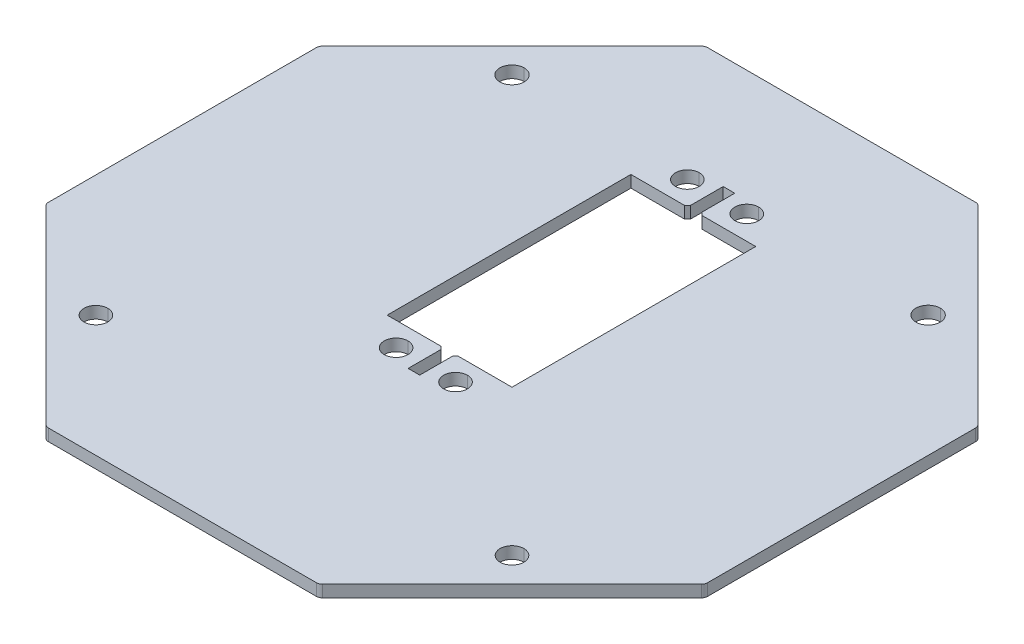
ISO-10303-21;
HEADER;
FILE_DESCRIPTION(('STEP AP214'),'2;1');
FILE_NAME('part.step','',(''),(''),'','','');
FILE_SCHEMA(('AUTOMOTIVE_DESIGN { 1 0 10303 214 1 1 1 1 }'));
ENDSEC;
DATA;
#1=APPLICATION_CONTEXT('core data for automotive mechanical design processes');
#2=APPLICATION_PROTOCOL_DEFINITION('international standard','automotive_design',2000,#1);
#3=PRODUCT_CONTEXT('',#1,'mechanical');
#4=PRODUCT('Part','Part','',(#3));
#5=PRODUCT_RELATED_PRODUCT_CATEGORY('part','',(#4));
#6=PRODUCT_DEFINITION_FORMATION('','',#4);
#7=PRODUCT_DEFINITION_CONTEXT('part definition',#1,'design');
#8=PRODUCT_DEFINITION('design','',#6,#7);
#9=PRODUCT_DEFINITION_SHAPE('','',#8);
#10=(LENGTH_UNIT() NAMED_UNIT(*) SI_UNIT(.MILLI.,.METRE.));
#11=(NAMED_UNIT(*) PLANE_ANGLE_UNIT() SI_UNIT($,.RADIAN.));
#12=(NAMED_UNIT(*) SI_UNIT($,.STERADIAN.) SOLID_ANGLE_UNIT());
#13=UNCERTAINTY_MEASURE_WITH_UNIT(LENGTH_MEASURE(1.E-05),#10,'distance_accuracy_value','');
#14=(GEOMETRIC_REPRESENTATION_CONTEXT(3) GLOBAL_UNCERTAINTY_ASSIGNED_CONTEXT((#13)) GLOBAL_UNIT_ASSIGNED_CONTEXT((#10,
#11,#12)) REPRESENTATION_CONTEXT('',''));
#15=CARTESIAN_POINT('',(0.,0.,0.));
#16=DIRECTION('',(0.,0.,1.));
#17=DIRECTION('',(1.,0.,0.));
#18=AXIS2_PLACEMENT_3D('',#15,#16,#17);
#19=CARTESIAN_POINT('',(253.9989878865,-2.,-416.9629433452));
#20=DIRECTION('',(0.,1.,0.));
#21=DIRECTION('',(0.,0.,1.));
#22=AXIS2_PLACEMENT_3D('',#19,#20,#21);
#23=CYLINDRICAL_SURFACE('',#22,2.);
#24=DIRECTION('',(0.,-1.,0.));
#25=VECTOR('',#24,1.);
#26=CARTESIAN_POINT('',(253.9989878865,0.,-418.9629433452));
#27=LINE('',#26,#25);
#28=CARTESIAN_POINT('',(253.9989878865,0.,-418.9629433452));
#29=VERTEX_POINT('',#28);
#30=CARTESIAN_POINT('',(253.9989878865,-2.,-418.9629433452));
#31=VERTEX_POINT('',#30);
#32=EDGE_CURVE('E11',#29,#31,#27,.T.);
#33=ORIENTED_EDGE('',*,*,#32,.F.);
#34=CARTESIAN_POINT('',(253.9989878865,0.,-416.9629433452));
#35=DIRECTION('',(0.,-1.,0.));
#36=DIRECTION('',(0.,0.,1.));
#37=AXIS2_PLACEMENT_3D('',#34,#35,#36);
#38=CIRCLE('',#37,2.);
#39=CARTESIAN_POINT('',(253.9989878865,0.,-414.9629433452));
#40=VERTEX_POINT('',#39);
#41=EDGE_CURVE('E802',#40,#29,#38,.T.);
#42=ORIENTED_EDGE('',*,*,#41,.F.);
#43=DIRECTION('',(0.,-1.,0.));
#44=VECTOR('',#43,1.);
#45=CARTESIAN_POINT('',(253.9989878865,0.,-414.9629433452));
#46=LINE('',#45,#44);
#47=CARTESIAN_POINT('',(253.9989878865,-2.,-414.9629433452));
#48=VERTEX_POINT('',#47);
#49=EDGE_CURVE('E28',#40,#48,#46,.T.);
#50=ORIENTED_EDGE('',*,*,#49,.T.);
#51=CARTESIAN_POINT('',(253.9989878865,-2.,-416.9629433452));
#52=DIRECTION('',(0.,1.,0.));
#53=DIRECTION('',(0.,0.,-1.));
#54=AXIS2_PLACEMENT_3D('',#51,#52,#53);
#55=CIRCLE('',#54,2.);
#56=EDGE_CURVE('E692',#31,#48,#55,.T.);
#57=ORIENTED_EDGE('',*,*,#56,.F.);
#58=EDGE_LOOP('',(#33,#42,#50,#57));
#59=FACE_BOUND('',#58,.T.);
#60=ADVANCED_FACE('F17',(#59),#23,.F.);
#61=CARTESIAN_POINT('',(253.9989878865,-2.,-416.9629433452));
#62=DIRECTION('',(0.,1.,0.));
#63=DIRECTION('',(0.,0.,1.));
#64=AXIS2_PLACEMENT_3D('',#61,#62,#63);
#65=CYLINDRICAL_SURFACE('',#64,2.);
#66=CARTESIAN_POINT('',(253.9989878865,-2.,-416.9629433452));
#67=DIRECTION('',(0.,1.,0.));
#68=DIRECTION('',(0.,0.,1.));
#69=AXIS2_PLACEMENT_3D('',#66,#67,#68);
#70=CIRCLE('',#69,2.);
#71=EDGE_CURVE('E493',#48,#31,#70,.T.);
#72=ORIENTED_EDGE('',*,*,#71,.F.);
#73=ORIENTED_EDGE('',*,*,#49,.F.);
#74=CARTESIAN_POINT('',(253.9989878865,0.,-416.9629433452));
#75=DIRECTION('',(0.,-1.,0.));
#76=DIRECTION('',(0.,0.,-1.));
#77=AXIS2_PLACEMENT_3D('',#74,#75,#76);
#78=CIRCLE('',#77,2.);
#79=EDGE_CURVE('E805',#29,#40,#78,.T.);
#80=ORIENTED_EDGE('',*,*,#79,.F.);
#81=ORIENTED_EDGE('',*,*,#32,.T.);
#82=EDGE_LOOP('',(#72,#73,#80,#81));
#83=FACE_BOUND('',#82,.T.);
#84=ADVANCED_FACE('F948',(#83),#65,.F.);
#85=CARTESIAN_POINT('',(253.9989878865,-2.,-465.9629433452));
#86=DIRECTION('',(0.,1.,0.));
#87=DIRECTION('',(0.,0.,1.));
#88=AXIS2_PLACEMENT_3D('',#85,#86,#87);
#89=CYLINDRICAL_SURFACE('',#88,2.);
#90=DIRECTION('',(0.,-1.,0.));
#91=VECTOR('',#90,1.);
#92=CARTESIAN_POINT('',(253.9989878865,0.,-467.9629433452));
#93=LINE('',#92,#91);
#94=CARTESIAN_POINT('',(253.9989878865,0.,-467.9629433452));
#95=VERTEX_POINT('',#94);
#96=CARTESIAN_POINT('',(253.9989878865,-2.,-467.9629433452));
#97=VERTEX_POINT('',#96);
#98=EDGE_CURVE('E527',#95,#97,#93,.T.);
#99=ORIENTED_EDGE('',*,*,#98,.F.);
#100=CARTESIAN_POINT('',(253.9989878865,0.,-465.9629433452));
#101=DIRECTION('',(0.,-1.,0.));
#102=DIRECTION('',(0.,0.,1.));
#103=AXIS2_PLACEMENT_3D('',#100,#101,#102);
#104=CIRCLE('',#103,2.);
#105=CARTESIAN_POINT('',(253.9989878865,0.,-463.9629433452));
#106=VERTEX_POINT('',#105);
#107=EDGE_CURVE('E724',#106,#95,#104,.T.);
#108=ORIENTED_EDGE('',*,*,#107,.F.);
#109=DIRECTION('',(0.,-1.,0.));
#110=VECTOR('',#109,1.);
#111=CARTESIAN_POINT('',(253.9989878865,0.,-463.9629433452));
#112=LINE('',#111,#110);
#113=CARTESIAN_POINT('',(253.9989878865,-2.,-463.9629433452));
#114=VERTEX_POINT('',#113);
#115=EDGE_CURVE('E530',#106,#114,#112,.T.);
#116=ORIENTED_EDGE('',*,*,#115,.T.);
#117=CARTESIAN_POINT('',(253.9989878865,-2.,-465.9629433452));
#118=DIRECTION('',(0.,1.,0.));
#119=DIRECTION('',(0.,0.,-1.));
#120=AXIS2_PLACEMENT_3D('',#117,#118,#119);
#121=CIRCLE('',#120,2.);
#122=EDGE_CURVE('E827',#97,#114,#121,.T.);
#123=ORIENTED_EDGE('',*,*,#122,.F.);
#124=EDGE_LOOP('',(#99,#108,#116,#123));
#125=FACE_BOUND('',#124,.T.);
#126=ADVANCED_FACE('F1010',(#125),#89,.F.);
#127=CARTESIAN_POINT('',(253.9989878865,-2.,-465.9629433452));
#128=DIRECTION('',(0.,1.,0.));
#129=DIRECTION('',(0.,0.,1.));
#130=AXIS2_PLACEMENT_3D('',#127,#128,#129);
#131=CYLINDRICAL_SURFACE('',#130,2.);
#132=CARTESIAN_POINT('',(253.9989878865,-2.,-465.9629433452));
#133=DIRECTION('',(0.,1.,0.));
#134=DIRECTION('',(0.,0.,1.));
#135=AXIS2_PLACEMENT_3D('',#132,#133,#134);
#136=CIRCLE('',#135,2.);
#137=EDGE_CURVE('E696',#114,#97,#136,.T.);
#138=ORIENTED_EDGE('',*,*,#137,.F.);
#139=ORIENTED_EDGE('',*,*,#115,.F.);
#140=CARTESIAN_POINT('',(253.9989878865,0.,-465.9629433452));
#141=DIRECTION('',(0.,-1.,0.));
#142=DIRECTION('',(0.,0.,-1.));
#143=AXIS2_PLACEMENT_3D('',#140,#141,#142);
#144=CIRCLE('',#143,2.);
#145=EDGE_CURVE('E806',#95,#106,#144,.T.);
#146=ORIENTED_EDGE('',*,*,#145,.F.);
#147=ORIENTED_EDGE('',*,*,#98,.T.);
#148=EDGE_LOOP('',(#138,#139,#146,#147));
#149=FACE_BOUND('',#148,.T.);
#150=ADVANCED_FACE('F1030',(#149),#131,.F.);
#151=CARTESIAN_POINT('',(213.9989878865,-2.,-466.4629433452));
#152=DIRECTION('',(0.,1.,0.));
#153=DIRECTION('',(0.,0.,1.));
#154=AXIS2_PLACEMENT_3D('',#151,#152,#153);
#155=CYLINDRICAL_SURFACE('',#154,2.05);
#156=DIRECTION('',(0.,-1.,0.));
#157=VECTOR('',#156,1.);
#158=CARTESIAN_POINT('',(213.9989878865,0.,-468.5129433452));
#159=LINE('',#158,#157);
#160=CARTESIAN_POINT('',(213.9989878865,0.,-468.5129433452));
#161=VERTEX_POINT('',#160);
#162=CARTESIAN_POINT('',(213.9989878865,-2.,-468.5129433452));
#163=VERTEX_POINT('',#162);
#164=EDGE_CURVE('E635',#161,#163,#159,.T.);
#165=ORIENTED_EDGE('',*,*,#164,.F.);
#166=CARTESIAN_POINT('',(213.9989878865,0.,-466.4629433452));
#167=DIRECTION('',(0.,-1.,0.));
#168=DIRECTION('',(0.,0.,1.));
#169=AXIS2_PLACEMENT_3D('',#166,#167,#168);
#170=CIRCLE('',#169,2.05);
#171=CARTESIAN_POINT('',(213.9989878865,0.,-464.4129433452));
#172=VERTEX_POINT('',#171);
#173=EDGE_CURVE('E21',#172,#161,#170,.T.);
#174=ORIENTED_EDGE('',*,*,#173,.F.);
#175=DIRECTION('',(0.,-1.,0.));
#176=VECTOR('',#175,1.);
#177=CARTESIAN_POINT('',(213.9989878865,0.,-464.4129433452));
#178=LINE('',#177,#176);
#179=CARTESIAN_POINT('',(213.9989878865,-2.,-464.4129433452));
#180=VERTEX_POINT('',#179);
#181=EDGE_CURVE('E632',#172,#180,#178,.T.);
#182=ORIENTED_EDGE('',*,*,#181,.T.);
#183=CARTESIAN_POINT('',(213.9989878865,-2.,-466.4629433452));
#184=DIRECTION('',(0.,1.,0.));
#185=DIRECTION('',(0.,0.,-1.));
#186=AXIS2_PLACEMENT_3D('',#183,#184,#185);
#187=CIRCLE('',#186,2.05);
#188=EDGE_CURVE('E699',#163,#180,#187,.T.);
#189=ORIENTED_EDGE('',*,*,#188,.F.);
#190=EDGE_LOOP('',(#165,#174,#182,#189));
#191=FACE_BOUND('',#190,.T.);
#192=ADVANCED_FACE('F963',(#191),#155,.F.);
#193=CARTESIAN_POINT('',(213.9989878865,-2.,-466.4629433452));
#194=DIRECTION('',(0.,1.,0.));
#195=DIRECTION('',(0.,0.,1.));
#196=AXIS2_PLACEMENT_3D('',#193,#194,#195);
#197=CYLINDRICAL_SURFACE('',#196,2.05);
#198=CARTESIAN_POINT('',(213.9989878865,-2.,-466.4629433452));
#199=DIRECTION('',(0.,1.,0.));
#200=DIRECTION('',(0.,0.,1.));
#201=AXIS2_PLACEMENT_3D('',#198,#199,#200);
#202=CIRCLE('',#201,2.05);
#203=EDGE_CURVE('E703',#180,#163,#202,.T.);
#204=ORIENTED_EDGE('',*,*,#203,.F.);
#205=ORIENTED_EDGE('',*,*,#181,.F.);
#206=CARTESIAN_POINT('',(213.9989878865,0.,-466.4629433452));
#207=DIRECTION('',(0.,-1.,0.));
#208=DIRECTION('',(0.,0.,-1.));
#209=AXIS2_PLACEMENT_3D('',#206,#207,#208);
#210=CIRCLE('',#209,2.05);
#211=EDGE_CURVE('E720',#161,#172,#210,.T.);
#212=ORIENTED_EDGE('',*,*,#211,.F.);
#213=ORIENTED_EDGE('',*,*,#164,.T.);
#214=EDGE_LOOP('',(#204,#205,#212,#213));
#215=FACE_BOUND('',#214,.T.);
#216=ADVANCED_FACE('F968',(#215),#197,.F.);
#217=CARTESIAN_POINT('',(259.4989878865,-2.,-420.9629433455));
#218=DIRECTION('',(1.,0.,0.));
#219=DIRECTION('',(0.,0.,-1.));
#220=AXIS2_PLACEMENT_3D('',#217,#218,#219);
#221=PLANE('',#220);
#222=DIRECTION('',(0.,-1.,0.));
#223=VECTOR('',#222,1.);
#224=CARTESIAN_POINT('',(259.4989878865,0.,-461.9629433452));
#225=LINE('',#224,#223);
#226=CARTESIAN_POINT('',(259.4989878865,0.,-461.9629433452));
#227=VERTEX_POINT('',#226);
#228=CARTESIAN_POINT('',(259.4989878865,-2.,-461.9629433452));
#229=VERTEX_POINT('',#228);
#230=EDGE_CURVE('E636',#227,#229,#225,.T.);
#231=ORIENTED_EDGE('',*,*,#230,.T.);
#232=DIRECTION('',(0.,0.,1.));
#233=VECTOR('',#232,1.);
#234=CARTESIAN_POINT('',(259.4989878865,-2.,-461.9629433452));
#235=LINE('',#234,#233);
#236=CARTESIAN_POINT('',(259.4989878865,-2.,-420.9629433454));
#237=VERTEX_POINT('',#236);
#238=EDGE_CURVE('E541',#229,#237,#235,.T.);
#239=ORIENTED_EDGE('',*,*,#238,.T.);
#240=DIRECTION('',(0.,-1.,0.));
#241=VECTOR('',#240,1.);
#242=CARTESIAN_POINT('',(259.4989878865,0.,-420.9629433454));
#243=LINE('',#242,#241);
#244=CARTESIAN_POINT('',(259.4989878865,0.,-420.9629433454));
#245=VERTEX_POINT('',#244);
#246=EDGE_CURVE('E679',#245,#237,#243,.T.);
#247=ORIENTED_EDGE('',*,*,#246,.F.);
#248=DIRECTION('',(0.,0.,1.));
#249=VECTOR('',#248,1.);
#250=CARTESIAN_POINT('',(259.4989878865,0.,-461.9629433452));
#251=LINE('',#250,#249);
#252=EDGE_CURVE('E813',#227,#245,#251,.T.);
#253=ORIENTED_EDGE('',*,*,#252,.F.);
#254=EDGE_LOOP('',(#231,#239,#247,#253));
#255=FACE_BOUND('',#254,.T.);
#256=ADVANCED_FACE('F1108',(#255),#221,.F.);
#257=CARTESIAN_POINT('',(259.4989878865,-2.,-461.9629433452));
#258=DIRECTION('',(0.,0.,-1.));
#259=DIRECTION('',(0.,-1.,0.));
#260=AXIS2_PLACEMENT_3D('',#257,#258,#259);
#261=PLANE('',#260);
#262=DIRECTION('',(0.,-1.,0.));
#263=VECTOR('',#262,1.);
#264=CARTESIAN_POINT('',(250.4739878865,0.,-461.9629433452));
#265=LINE('',#264,#263);
#266=CARTESIAN_POINT('',(250.4739878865,0.,-461.9629433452));
#267=VERTEX_POINT('',#266);
#268=CARTESIAN_POINT('',(250.4739878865,-2.,-461.9629433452));
#269=VERTEX_POINT('',#268);
#270=EDGE_CURVE('E86',#267,#269,#265,.T.);
#271=ORIENTED_EDGE('',*,*,#270,.T.);
#272=DIRECTION('',(1.,0.,0.));
#273=VECTOR('',#272,1.);
#274=CARTESIAN_POINT('',(250.4739878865,-2.,-461.9629433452));
#275=LINE('',#274,#273);
#276=EDGE_CURVE('E537',#269,#229,#275,.T.);
#277=ORIENTED_EDGE('',*,*,#276,.T.);
#278=ORIENTED_EDGE('',*,*,#230,.F.);
#279=DIRECTION('',(1.,0.,0.));
#280=VECTOR('',#279,1.);
#281=CARTESIAN_POINT('',(250.4739878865,0.,-461.9629433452));
#282=LINE('',#281,#280);
#283=EDGE_CURVE('E818',#267,#227,#282,.T.);
#284=ORIENTED_EDGE('',*,*,#283,.F.);
#285=EDGE_LOOP('',(#271,#277,#278,#284));
#286=FACE_BOUND('',#285,.T.);
#287=ADVANCED_FACE('F1111',(#286),#261,.F.);
#288=CARTESIAN_POINT('',(249.9739878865,-2.,-462.4629433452));
#289=DIRECTION('',(0.707106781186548,0.,-0.707106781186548));
#290=DIRECTION('',(0.,-1.,0.));
#291=AXIS2_PLACEMENT_3D('',#288,#289,#290);
#292=PLANE('',#291);
#293=DIRECTION('',(0.,-1.,0.));
#294=VECTOR('',#293,1.);
#295=CARTESIAN_POINT('',(249.9739878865,0.,-462.4629433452));
#296=LINE('',#295,#294);
#297=CARTESIAN_POINT('',(249.9739878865,0.,-462.4629433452));
#298=VERTEX_POINT('',#297);
#299=CARTESIAN_POINT('',(249.9739878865,-2.,-462.4629433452));
#300=VERTEX_POINT('',#299);
#301=EDGE_CURVE('E69',#298,#300,#296,.T.);
#302=ORIENTED_EDGE('',*,*,#301,.T.);
#303=DIRECTION('',(-0.707106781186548,0.,-0.707106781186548));
#304=VECTOR('',#303,1.);
#305=CARTESIAN_POINT('',(250.4739878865,-2.,-461.9629433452));
#306=LINE('',#305,#304);
#307=EDGE_CURVE('E540',#269,#300,#306,.T.);
#308=ORIENTED_EDGE('',*,*,#307,.F.);
#309=ORIENTED_EDGE('',*,*,#270,.F.);
#310=DIRECTION('',(0.707106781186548,0.,0.707106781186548));
#311=VECTOR('',#310,1.);
#312=CARTESIAN_POINT('',(249.9739878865,0.,-462.4629433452));
#313=LINE('',#312,#311);
#314=EDGE_CURVE('E835',#298,#267,#313,.T.);
#315=ORIENTED_EDGE('',*,*,#314,.F.);
#316=EDGE_LOOP('',(#302,#308,#309,#315));
#317=FACE_BOUND('',#316,.T.);
#318=ADVANCED_FACE('F1114',(#317),#292,.F.);
#319=CARTESIAN_POINT('',(249.9739878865,-2.,-462.4629433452));
#320=DIRECTION('',(1.,0.,0.));
#321=DIRECTION('',(0.,1.,0.));
#322=AXIS2_PLACEMENT_3D('',#319,#320,#321);
#323=PLANE('',#322);
#324=DIRECTION('',(0.,-1.,0.));
#325=VECTOR('',#324,1.);
#326=CARTESIAN_POINT('',(249.9739878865,0.,-467.9629433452));
#327=LINE('',#326,#325);
#328=CARTESIAN_POINT('',(249.9739878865,0.,-467.9629433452));
#329=VERTEX_POINT('',#328);
#330=CARTESIAN_POINT('',(249.9739878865,-2.,-467.9629433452));
#331=VERTEX_POINT('',#330);
#332=EDGE_CURVE('E729',#329,#331,#327,.T.);
#333=ORIENTED_EDGE('',*,*,#332,.T.);
#334=DIRECTION('',(0.,0.,1.));
#335=VECTOR('',#334,1.);
#336=CARTESIAN_POINT('',(249.9739878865,-2.,-467.9629433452));
#337=LINE('',#336,#335);
#338=EDGE_CURVE('E590',#331,#300,#337,.T.);
#339=ORIENTED_EDGE('',*,*,#338,.T.);
#340=ORIENTED_EDGE('',*,*,#301,.F.);
#341=DIRECTION('',(0.,0.,1.));
#342=VECTOR('',#341,1.);
#343=CARTESIAN_POINT('',(249.9739878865,0.,-467.9629433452));
#344=LINE('',#343,#342);
#345=EDGE_CURVE('E831',#329,#298,#344,.T.);
#346=ORIENTED_EDGE('',*,*,#345,.F.);
#347=EDGE_LOOP('',(#333,#339,#340,#346));
#348=FACE_BOUND('',#347,.T.);
#349=ADVANCED_FACE('F1116',(#348),#323,.F.);
#350=CARTESIAN_POINT('',(249.9739878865,-2.,-467.9629433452));
#351=DIRECTION('',(0.,0.,-1.));
#352=DIRECTION('',(0.,-1.,0.));
#353=AXIS2_PLACEMENT_3D('',#350,#351,#352);
#354=PLANE('',#353);
#355=DIRECTION('',(0.,-1.,0.));
#356=VECTOR('',#355,1.);
#357=CARTESIAN_POINT('',(248.0239878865,0.,-467.9629433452));
#358=LINE('',#357,#356);
#359=CARTESIAN_POINT('',(248.0239878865,0.,-467.9629433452));
#360=VERTEX_POINT('',#359);
#361=CARTESIAN_POINT('',(248.0239878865,-2.,-467.9629433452));
#362=VERTEX_POINT('',#361);
#363=EDGE_CURVE('E754',#360,#362,#358,.T.);
#364=ORIENTED_EDGE('',*,*,#363,.T.);
#365=DIRECTION('',(1.,0.,0.));
#366=VECTOR('',#365,1.);
#367=CARTESIAN_POINT('',(248.0239878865,-2.,-467.9629433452));
#368=LINE('',#367,#366);
#369=EDGE_CURVE('E504',#362,#331,#368,.T.);
#370=ORIENTED_EDGE('',*,*,#369,.T.);
#371=ORIENTED_EDGE('',*,*,#332,.F.);
#372=DIRECTION('',(1.,0.,0.));
#373=VECTOR('',#372,1.);
#374=CARTESIAN_POINT('',(248.0239878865,0.,-467.9629433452));
#375=LINE('',#374,#373);
#376=EDGE_CURVE('E811',#360,#329,#375,.T.);
#377=ORIENTED_EDGE('',*,*,#376,.F.);
#378=EDGE_LOOP('',(#364,#370,#371,#377));
#379=FACE_BOUND('',#378,.T.);
#380=ADVANCED_FACE('F1026',(#379),#354,.F.);
#381=CARTESIAN_POINT('',(248.0239878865,-2.,-467.9629433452));
#382=DIRECTION('',(-1.,0.,0.));
#383=DIRECTION('',(0.,0.,1.));
#384=AXIS2_PLACEMENT_3D('',#381,#382,#383);
#385=PLANE('',#384);
#386=DIRECTION('',(0.,-1.,0.));
#387=VECTOR('',#386,1.);
#388=CARTESIAN_POINT('',(248.0239878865,0.,-462.4629433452));
#389=LINE('',#388,#387);
#390=CARTESIAN_POINT('',(248.0239878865,0.,-462.4629433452));
#391=VERTEX_POINT('',#390);
#392=CARTESIAN_POINT('',(248.0239878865,-2.,-462.4629433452));
#393=VERTEX_POINT('',#392);
#394=EDGE_CURVE('E751',#391,#393,#389,.T.);
#395=ORIENTED_EDGE('',*,*,#394,.T.);
#396=DIRECTION('',(0.,0.,-1.));
#397=VECTOR('',#396,1.);
#398=CARTESIAN_POINT('',(248.0239878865,-2.,-462.4629433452));
#399=LINE('',#398,#397);
#400=EDGE_CURVE('E499',#393,#362,#399,.T.);
#401=ORIENTED_EDGE('',*,*,#400,.T.);
#402=ORIENTED_EDGE('',*,*,#363,.F.);
#403=DIRECTION('',(0.,0.,-1.));
#404=VECTOR('',#403,1.);
#405=CARTESIAN_POINT('',(248.0239878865,0.,-462.4629433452));
#406=LINE('',#405,#404);
#407=EDGE_CURVE('E807',#391,#360,#406,.T.);
#408=ORIENTED_EDGE('',*,*,#407,.F.);
#409=EDGE_LOOP('',(#395,#401,#402,#408));
#410=FACE_BOUND('',#409,.T.);
#411=ADVANCED_FACE('F1022',(#410),#385,.F.);
#412=CARTESIAN_POINT('',(247.5239878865,-2.,-461.9629433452));
#413=DIRECTION('',(-0.707106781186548,0.,-0.707106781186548));
#414=DIRECTION('',(-0.707106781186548,0.,0.707106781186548));
#415=AXIS2_PLACEMENT_3D('',#412,#413,#414);
#416=PLANE('',#415);
#417=DIRECTION('',(0.,-1.,0.));
#418=VECTOR('',#417,1.);
#419=CARTESIAN_POINT('',(247.5239878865,0.,-461.9629433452));
#420=LINE('',#419,#418);
#421=CARTESIAN_POINT('',(247.5239878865,0.,-461.9629433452));
#422=VERTEX_POINT('',#421);
#423=CARTESIAN_POINT('',(247.5239878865,-2.,-461.9629433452));
#424=VERTEX_POINT('',#423);
#425=EDGE_CURVE('E612',#422,#424,#420,.T.);
#426=ORIENTED_EDGE('',*,*,#425,.T.);
#427=DIRECTION('',(-0.707106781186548,0.,0.707106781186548));
#428=VECTOR('',#427,1.);
#429=CARTESIAN_POINT('',(248.0239878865,-2.,-462.4629433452));
#430=LINE('',#429,#428);
#431=EDGE_CURVE('E503',#393,#424,#430,.T.);
#432=ORIENTED_EDGE('',*,*,#431,.F.);
#433=ORIENTED_EDGE('',*,*,#394,.F.);
#434=DIRECTION('',(0.707106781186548,0.,-0.707106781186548));
#435=VECTOR('',#434,1.);
#436=CARTESIAN_POINT('',(247.5239878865,0.,-461.9629433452));
#437=LINE('',#436,#435);
#438=EDGE_CURVE('E812',#422,#391,#437,.T.);
#439=ORIENTED_EDGE('',*,*,#438,.F.);
#440=EDGE_LOOP('',(#426,#432,#433,#439));
#441=FACE_BOUND('',#440,.T.);
#442=ADVANCED_FACE('F1025',(#441),#416,.F.);
#443=CARTESIAN_POINT('',(247.5239878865,-2.,-461.9629433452));
#444=DIRECTION('',(0.,0.,-1.));
#445=DIRECTION('',(-1.,0.,0.));
#446=AXIS2_PLACEMENT_3D('',#443,#444,#445);
#447=PLANE('',#446);
#448=DIRECTION('',(0.,-1.,0.));
#449=VECTOR('',#448,1.);
#450=CARTESIAN_POINT('',(238.4989878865,0.,-461.9629433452));
#451=LINE('',#450,#449);
#452=CARTESIAN_POINT('',(238.4989878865,0.,-461.9629433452));
#453=VERTEX_POINT('',#452);
#454=CARTESIAN_POINT('',(238.4989878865,-2.,-461.9629433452));
#455=VERTEX_POINT('',#454);
#456=EDGE_CURVE('E609',#453,#455,#451,.T.);
#457=ORIENTED_EDGE('',*,*,#456,.T.);
#458=DIRECTION('',(1.,0.,0.));
#459=VECTOR('',#458,1.);
#460=CARTESIAN_POINT('',(238.4989878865,-2.,-461.9629433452));
#461=LINE('',#460,#459);
#462=EDGE_CURVE('E585',#455,#424,#461,.T.);
#463=ORIENTED_EDGE('',*,*,#462,.T.);
#464=ORIENTED_EDGE('',*,*,#425,.F.);
#465=DIRECTION('',(1.,0.,0.));
#466=VECTOR('',#465,1.);
#467=CARTESIAN_POINT('',(238.4989878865,0.,-461.9629433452));
#468=LINE('',#467,#466);
#469=EDGE_CURVE('E607',#453,#422,#468,.T.);
#470=ORIENTED_EDGE('',*,*,#469,.F.);
#471=EDGE_LOOP('',(#457,#463,#464,#470));
#472=FACE_BOUND('',#471,.T.);
#473=ADVANCED_FACE('F1014',(#472),#447,.F.);
#474=CARTESIAN_POINT('',(238.4989878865,-2.,-461.9629433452));
#475=DIRECTION('',(-1.,0.,0.));
#476=DIRECTION('',(0.,1.,0.));
#477=AXIS2_PLACEMENT_3D('',#474,#475,#476);
#478=PLANE('',#477);
#479=DIRECTION('',(0.,-1.,0.));
#480=VECTOR('',#479,1.);
#481=CARTESIAN_POINT('',(238.4989878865,0.,-420.9629433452));
#482=LINE('',#481,#480);
#483=CARTESIAN_POINT('',(238.4989878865,0.,-420.9629433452));
#484=VERTEX_POINT('',#483);
#485=CARTESIAN_POINT('',(238.4989878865,-2.,-420.9629433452));
#486=VERTEX_POINT('',#485);
#487=EDGE_CURVE('E613',#484,#486,#482,.T.);
#488=ORIENTED_EDGE('',*,*,#487,.T.);
#489=DIRECTION('',(0.,0.,-1.));
#490=VECTOR('',#489,1.);
#491=CARTESIAN_POINT('',(238.4989878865,-2.,-420.9629433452));
#492=LINE('',#491,#490);
#493=EDGE_CURVE('E844',#486,#455,#492,.T.);
#494=ORIENTED_EDGE('',*,*,#493,.T.);
#495=ORIENTED_EDGE('',*,*,#456,.F.);
#496=DIRECTION('',(0.,0.,-1.));
#497=VECTOR('',#496,1.);
#498=CARTESIAN_POINT('',(238.4989878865,0.,-420.9629433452));
#499=LINE('',#498,#497);
#500=EDGE_CURVE('E603',#484,#453,#499,.T.);
#501=ORIENTED_EDGE('',*,*,#500,.F.);
#502=EDGE_LOOP('',(#488,#494,#495,#501));
#503=FACE_BOUND('',#502,.T.);
#504=ADVANCED_FACE('F1060',(#503),#478,.F.);
#505=CARTESIAN_POINT('',(238.4989878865,-2.,-420.9629433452));
#506=DIRECTION('',(0.,0.,1.));
#507=DIRECTION('',(1.,0.,0.));
#508=AXIS2_PLACEMENT_3D('',#505,#506,#507);
#509=PLANE('',#508);
#510=DIRECTION('',(0.,-1.,0.));
#511=VECTOR('',#510,1.);
#512=CARTESIAN_POINT('',(247.5239878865,0.,-420.9629433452));
#513=LINE('',#512,#511);
#514=CARTESIAN_POINT('',(247.5239878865,0.,-420.9629433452));
#515=VERTEX_POINT('',#514);
#516=CARTESIAN_POINT('',(247.5239878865,-2.,-420.9629433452));
#517=VERTEX_POINT('',#516);
#518=EDGE_CURVE('E647',#515,#517,#513,.T.);
#519=ORIENTED_EDGE('',*,*,#518,.T.);
#520=DIRECTION('',(-1.,0.,0.));
#521=VECTOR('',#520,1.);
#522=CARTESIAN_POINT('',(247.5239878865,-2.,-420.9629433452));
#523=LINE('',#522,#521);
#524=EDGE_CURVE('E473',#517,#486,#523,.T.);
#525=ORIENTED_EDGE('',*,*,#524,.T.);
#526=ORIENTED_EDGE('',*,*,#487,.F.);
#527=DIRECTION('',(-1.,0.,0.));
#528=VECTOR('',#527,1.);
#529=CARTESIAN_POINT('',(247.5239878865,0.,-420.9629433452));
#530=LINE('',#529,#528);
#531=EDGE_CURVE('E608',#515,#484,#530,.T.);
#532=ORIENTED_EDGE('',*,*,#531,.F.);
#533=EDGE_LOOP('',(#519,#525,#526,#532));
#534=FACE_BOUND('',#533,.T.);
#535=ADVANCED_FACE('F1058',(#534),#509,.F.);
#536=CARTESIAN_POINT('',(248.0239878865,-2.,-420.4629433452));
#537=DIRECTION('',(-0.707106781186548,0.,0.707106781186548));
#538=DIRECTION('',(0.,1.,0.));
#539=AXIS2_PLACEMENT_3D('',#536,#537,#538);
#540=PLANE('',#539);
#541=DIRECTION('',(0.,-1.,0.));
#542=VECTOR('',#541,1.);
#543=CARTESIAN_POINT('',(248.0239878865,0.,-420.4629433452));
#544=LINE('',#543,#542);
#545=CARTESIAN_POINT('',(248.0239878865,0.,-420.4629433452));
#546=VERTEX_POINT('',#545);
#547=CARTESIAN_POINT('',(248.0239878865,-2.,-420.4629433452));
#548=VERTEX_POINT('',#547);
#549=EDGE_CURVE('E449',#546,#548,#544,.T.);
#550=ORIENTED_EDGE('',*,*,#549,.T.);
#551=DIRECTION('',(0.707106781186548,0.,0.707106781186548));
#552=VECTOR('',#551,1.);
#553=CARTESIAN_POINT('',(247.5239878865,-2.,-420.9629433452));
#554=LINE('',#553,#552);
#555=EDGE_CURVE('E466',#517,#548,#554,.T.);
#556=ORIENTED_EDGE('',*,*,#555,.F.);
#557=ORIENTED_EDGE('',*,*,#518,.F.);
#558=DIRECTION('',(-0.707106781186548,0.,-0.707106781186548));
#559=VECTOR('',#558,1.);
#560=CARTESIAN_POINT('',(248.0239878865,0.,-420.4629433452));
#561=LINE('',#560,#559);
#562=EDGE_CURVE('E826',#546,#515,#561,.T.);
#563=ORIENTED_EDGE('',*,*,#562,.F.);
#564=EDGE_LOOP('',(#550,#556,#557,#563));
#565=FACE_BOUND('',#564,.T.);
#566=ADVANCED_FACE('F1033',(#565),#540,.F.);
#567=CARTESIAN_POINT('',(248.0239878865,-2.,-420.4629433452));
#568=DIRECTION('',(-1.,0.,0.));
#569=DIRECTION('',(0.,0.,1.));
#570=AXIS2_PLACEMENT_3D('',#567,#568,#569);
#571=PLANE('',#570);
#572=DIRECTION('',(0.,-1.,0.));
#573=VECTOR('',#572,1.);
#574=CARTESIAN_POINT('',(248.0239878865,0.,-414.9629433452));
#575=LINE('',#574,#573);
#576=CARTESIAN_POINT('',(248.0239878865,0.,-414.9629433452));
#577=VERTEX_POINT('',#576);
#578=CARTESIAN_POINT('',(248.0239878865,-2.,-414.9629433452));
#579=VERTEX_POINT('',#578);
#580=EDGE_CURVE('E437',#577,#579,#575,.T.);
#581=ORIENTED_EDGE('',*,*,#580,.T.);
#582=DIRECTION('',(0.,0.,-1.));
#583=VECTOR('',#582,1.);
#584=CARTESIAN_POINT('',(248.0239878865,-2.,-414.9629433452));
#585=LINE('',#584,#583);
#586=EDGE_CURVE('E441',#579,#548,#585,.T.);
#587=ORIENTED_EDGE('',*,*,#586,.T.);
#588=ORIENTED_EDGE('',*,*,#549,.F.);
#589=DIRECTION('',(0.,0.,-1.));
#590=VECTOR('',#589,1.);
#591=CARTESIAN_POINT('',(248.0239878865,0.,-414.9629433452));
#592=LINE('',#591,#590);
#593=EDGE_CURVE('E444',#577,#546,#592,.T.);
#594=ORIENTED_EDGE('',*,*,#593,.F.);
#595=EDGE_LOOP('',(#581,#587,#588,#594));
#596=FACE_BOUND('',#595,.T.);
#597=ADVANCED_FACE('F439',(#596),#571,.F.);
#598=CARTESIAN_POINT('',(248.0239878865,-2.,-414.9629433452));
#599=DIRECTION('',(0.,0.,1.));
#600=DIRECTION('',(1.,0.,0.));
#601=AXIS2_PLACEMENT_3D('',#598,#599,#600);
#602=PLANE('',#601);
#603=DIRECTION('',(0.,-1.,0.));
#604=VECTOR('',#603,1.);
#605=CARTESIAN_POINT('',(249.9739878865,0.,-414.9629433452));
#606=LINE('',#605,#604);
#607=CARTESIAN_POINT('',(249.9739878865,0.,-414.9629433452));
#608=VERTEX_POINT('',#607);
#609=CARTESIAN_POINT('',(249.9739878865,-2.,-414.9629433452));
#610=VERTEX_POINT('',#609);
#611=EDGE_CURVE('E450',#608,#610,#606,.T.);
#612=ORIENTED_EDGE('',*,*,#611,.T.);
#613=DIRECTION('',(-1.,0.,0.));
#614=VECTOR('',#613,1.);
#615=CARTESIAN_POINT('',(249.9739878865,-2.,-414.9629433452));
#616=LINE('',#615,#614);
#617=EDGE_CURVE('E453',#610,#579,#616,.T.);
#618=ORIENTED_EDGE('',*,*,#617,.T.);
#619=ORIENTED_EDGE('',*,*,#580,.F.);
#620=DIRECTION('',(-1.,0.,0.));
#621=VECTOR('',#620,1.);
#622=CARTESIAN_POINT('',(249.9739878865,0.,-414.9629433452));
#623=LINE('',#622,#621);
#624=EDGE_CURVE('E597',#608,#577,#623,.T.);
#625=ORIENTED_EDGE('',*,*,#624,.F.);
#626=EDGE_LOOP('',(#612,#618,#619,#625));
#627=FACE_BOUND('',#626,.T.);
#628=ADVANCED_FACE('F454',(#627),#602,.F.);
#629=CARTESIAN_POINT('',(249.9739878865,-2.,-414.9629433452));
#630=DIRECTION('',(1.,0.,0.));
#631=DIRECTION('',(0.,1.,0.));
#632=AXIS2_PLACEMENT_3D('',#629,#630,#631);
#633=PLANE('',#632);
#634=DIRECTION('',(0.,-1.,0.));
#635=VECTOR('',#634,1.);
#636=CARTESIAN_POINT('',(249.9739878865,0.,-420.4629433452));
#637=LINE('',#636,#635);
#638=CARTESIAN_POINT('',(249.9739878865,0.,-420.4629433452));
#639=VERTEX_POINT('',#638);
#640=CARTESIAN_POINT('',(249.9739878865,-2.,-420.4629433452));
#641=VERTEX_POINT('',#640);
#642=EDGE_CURVE('E737',#639,#641,#637,.T.);
#643=ORIENTED_EDGE('',*,*,#642,.T.);
#644=DIRECTION('',(0.,0.,1.));
#645=VECTOR('',#644,1.);
#646=CARTESIAN_POINT('',(249.9739878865,-2.,-420.4629433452));
#647=LINE('',#646,#645);
#648=EDGE_CURVE('E459',#641,#610,#647,.T.);
#649=ORIENTED_EDGE('',*,*,#648,.T.);
#650=ORIENTED_EDGE('',*,*,#611,.F.);
#651=DIRECTION('',(0.,0.,1.));
#652=VECTOR('',#651,1.);
#653=CARTESIAN_POINT('',(249.9739878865,0.,-420.4629433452));
#654=LINE('',#653,#652);
#655=EDGE_CURVE('E593',#639,#608,#654,.T.);
#656=ORIENTED_EDGE('',*,*,#655,.F.);
#657=EDGE_LOOP('',(#643,#649,#650,#656));
#658=FACE_BOUND('',#657,.T.);
#659=ADVANCED_FACE('F1151',(#658),#633,.F.);
#660=CARTESIAN_POINT('',(250.4739878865,-2.,-420.9629433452));
#661=DIRECTION('',(0.707106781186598,0.,0.707106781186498));
#662=DIRECTION('',(0.,-1.,0.));
#663=AXIS2_PLACEMENT_3D('',#660,#661,#662);
#664=PLANE('',#663);
#665=DIRECTION('',(0.,-1.,0.));
#666=VECTOR('',#665,1.);
#667=CARTESIAN_POINT('',(250.4739878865,0.,-420.9629433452));
#668=LINE('',#667,#666);
#669=CARTESIAN_POINT('',(250.4739878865,0.,-420.9629433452));
#670=VERTEX_POINT('',#669);
#671=CARTESIAN_POINT('',(250.4739878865,-2.,-420.9629433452));
#672=VERTEX_POINT('',#671);
#673=EDGE_CURVE('E734',#670,#672,#668,.T.);
#674=ORIENTED_EDGE('',*,*,#673,.T.);
#675=DIRECTION('',(0.707106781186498,0.,-0.707106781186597));
#676=VECTOR('',#675,1.);
#677=CARTESIAN_POINT('',(249.9739878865,-2.,-420.4629433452));
#678=LINE('',#677,#676);
#679=EDGE_CURVE('E704',#641,#672,#678,.T.);
#680=ORIENTED_EDGE('',*,*,#679,.F.);
#681=ORIENTED_EDGE('',*,*,#642,.F.);
#682=DIRECTION('',(-0.707106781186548,0.,0.707106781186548));
#683=VECTOR('',#682,1.);
#684=CARTESIAN_POINT('',(250.4739878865,0.,-420.9629433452));
#685=LINE('',#684,#683);
#686=EDGE_CURVE('E598',#670,#639,#685,.T.);
#687=ORIENTED_EDGE('',*,*,#686,.F.);
#688=EDGE_LOOP('',(#674,#680,#681,#687));
#689=FACE_BOUND('',#688,.T.);
#690=ADVANCED_FACE('F1154',(#689),#664,.F.);
#691=CARTESIAN_POINT('',(250.4739878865,-2.,-420.9629433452));
#692=DIRECTION('',(2.694059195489E-11,0.,1.));
#693=DIRECTION('',(1.,0.,-2.694059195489E-11));
#694=AXIS2_PLACEMENT_3D('',#691,#692,#693);
#695=PLANE('',#694);
#696=ORIENTED_EDGE('',*,*,#246,.T.);
#697=DIRECTION('',(-1.,0.,1.796315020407E-11));
#698=VECTOR('',#697,1.);
#699=CARTESIAN_POINT('',(259.4989878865,-2.,-420.9629433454));
#700=LINE('',#699,#698);
#701=EDGE_CURVE('E730',#237,#672,#700,.T.);
#702=ORIENTED_EDGE('',*,*,#701,.T.);
#703=ORIENTED_EDGE('',*,*,#673,.F.);
#704=DIRECTION('',(-1.,0.,1.796944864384E-11));
#705=VECTOR('',#704,1.);
#706=CARTESIAN_POINT('',(259.4989878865,0.,-420.9629433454));
#707=LINE('',#706,#705);
#708=EDGE_CURVE('E817',#245,#670,#707,.T.);
#709=ORIENTED_EDGE('',*,*,#708,.F.);
#710=EDGE_LOOP('',(#696,#702,#703,#709));
#711=FACE_BOUND('',#710,.T.);
#712=ADVANCED_FACE('F19',(#711),#695,.F.);
#713=CARTESIAN_POINT('',(283.9989878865,-2.,-466.4629433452));
#714=DIRECTION('',(0.,1.,0.));
#715=DIRECTION('',(0.,0.,1.));
#716=AXIS2_PLACEMENT_3D('',#713,#714,#715);
#717=CYLINDRICAL_SURFACE('',#716,2.05);
#718=DIRECTION('',(0.,-1.,0.));
#719=VECTOR('',#718,1.);
#720=CARTESIAN_POINT('',(283.9989878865,0.,-468.5129433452));
#721=LINE('',#720,#719);
#722=CARTESIAN_POINT('',(283.9989878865,0.,-468.5129433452));
#723=VERTEX_POINT('',#722);
#724=CARTESIAN_POINT('',(283.9989878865,-2.,-468.5129433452));
#725=VERTEX_POINT('',#724);
#726=EDGE_CURVE('E623',#723,#725,#721,.T.);
#727=ORIENTED_EDGE('',*,*,#726,.F.);
#728=CARTESIAN_POINT('',(283.9989878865,0.,-466.4629433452));
#729=DIRECTION('',(0.,-1.,0.));
#730=DIRECTION('',(0.,0.,1.));
#731=AXIS2_PLACEMENT_3D('',#728,#729,#730);
#732=CIRCLE('',#731,2.05);
#733=CARTESIAN_POINT('',(283.9989878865,0.,-464.4129433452));
#734=VERTEX_POINT('',#733);
#735=EDGE_CURVE('E873',#734,#723,#732,.T.);
#736=ORIENTED_EDGE('',*,*,#735,.F.);
#737=DIRECTION('',(0.,-1.,0.));
#738=VECTOR('',#737,1.);
#739=CARTESIAN_POINT('',(283.9989878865,0.,-464.4129433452));
#740=LINE('',#739,#738);
#741=CARTESIAN_POINT('',(283.9989878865,-2.,-464.4129433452));
#742=VERTEX_POINT('',#741);
#743=EDGE_CURVE('E620',#734,#742,#740,.T.);
#744=ORIENTED_EDGE('',*,*,#743,.T.);
#745=CARTESIAN_POINT('',(283.9989878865,-2.,-466.4629433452));
#746=DIRECTION('',(0.,1.,0.));
#747=DIRECTION('',(0.,0.,-1.));
#748=AXIS2_PLACEMENT_3D('',#745,#746,#747);
#749=CIRCLE('',#748,2.05);
#750=EDGE_CURVE('E657',#725,#742,#749,.T.);
#751=ORIENTED_EDGE('',*,*,#750,.F.);
#752=EDGE_LOOP('',(#727,#736,#744,#751));
#753=FACE_BOUND('',#752,.T.);
#754=ADVANCED_FACE('F986',(#753),#717,.F.);
#755=CARTESIAN_POINT('',(283.9989878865,-2.,-466.4629433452));
#756=DIRECTION('',(0.,1.,0.));
#757=DIRECTION('',(0.,0.,1.));
#758=AXIS2_PLACEMENT_3D('',#755,#756,#757);
#759=CYLINDRICAL_SURFACE('',#758,2.05);
#760=CARTESIAN_POINT('',(283.9989878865,-2.,-466.4629433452));
#761=DIRECTION('',(0.,1.,0.));
#762=DIRECTION('',(0.,0.,1.));
#763=AXIS2_PLACEMENT_3D('',#760,#761,#762);
#764=CIRCLE('',#763,2.05);
#765=EDGE_CURVE('E661',#742,#725,#764,.T.);
#766=ORIENTED_EDGE('',*,*,#765,.F.);
#767=ORIENTED_EDGE('',*,*,#743,.F.);
#768=CARTESIAN_POINT('',(283.9989878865,0.,-466.4629433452));
#769=DIRECTION('',(0.,-1.,0.));
#770=DIRECTION('',(0.,0.,-1.));
#771=AXIS2_PLACEMENT_3D('',#768,#769,#770);
#772=CIRCLE('',#771,2.05);
#773=EDGE_CURVE('E666',#723,#734,#772,.T.);
#774=ORIENTED_EDGE('',*,*,#773,.F.);
#775=ORIENTED_EDGE('',*,*,#726,.T.);
#776=EDGE_LOOP('',(#766,#767,#774,#775));
#777=FACE_BOUND('',#776,.T.);
#778=ADVANCED_FACE('F989',(#777),#759,.F.);
#779=CARTESIAN_POINT('',(243.9989878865,-2.,-465.9629433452));
#780=DIRECTION('',(0.,1.,0.));
#781=DIRECTION('',(0.,0.,1.));
#782=AXIS2_PLACEMENT_3D('',#779,#780,#781);
#783=CYLINDRICAL_SURFACE('',#782,2.);
#784=CARTESIAN_POINT('',(243.9989878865,-2.,-465.9629433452));
#785=DIRECTION('',(0.,1.,0.));
#786=DIRECTION('',(0.,0.,1.));
#787=AXIS2_PLACEMENT_3D('',#784,#785,#786);
#788=CIRCLE('',#787,2.);
#789=CARTESIAN_POINT('',(243.9989878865,-2.,-463.9629433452));
#790=VERTEX_POINT('',#789);
#791=CARTESIAN_POINT('',(243.9989878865,-2.,-467.9629433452));
#792=VERTEX_POINT('',#791);
#793=EDGE_CURVE('E662',#790,#792,#788,.T.);
#794=ORIENTED_EDGE('',*,*,#793,.F.);
#795=DIRECTION('',(0.,-1.,0.));
#796=VECTOR('',#795,1.);
#797=CARTESIAN_POINT('',(243.9989878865,0.,-463.9629433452));
#798=LINE('',#797,#796);
#799=CARTESIAN_POINT('',(243.9989878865,0.,-463.9629433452));
#800=VERTEX_POINT('',#799);
#801=EDGE_CURVE('E542',#800,#790,#798,.T.);
#802=ORIENTED_EDGE('',*,*,#801,.F.);
#803=CARTESIAN_POINT('',(243.9989878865,0.,-465.9629433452));
#804=DIRECTION('',(0.,-1.,0.));
#805=DIRECTION('',(0.,0.,-1.));
#806=AXIS2_PLACEMENT_3D('',#803,#804,#805);
#807=CIRCLE('',#806,2.);
#808=CARTESIAN_POINT('',(243.9989878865,0.,-467.9629433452));
#809=VERTEX_POINT('',#808);
#810=EDGE_CURVE('E627',#809,#800,#807,.T.);
#811=ORIENTED_EDGE('',*,*,#810,.F.);
#812=DIRECTION('',(0.,-1.,0.));
#813=VECTOR('',#812,1.);
#814=CARTESIAN_POINT('',(243.9989878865,0.,-467.9629433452));
#815=LINE('',#814,#813);
#816=EDGE_CURVE('E589',#809,#792,#815,.T.);
#817=ORIENTED_EDGE('',*,*,#816,.T.);
#818=EDGE_LOOP('',(#794,#802,#811,#817));
#819=FACE_BOUND('',#818,.T.);
#820=ADVANCED_FACE('F793',(#819),#783,.F.);
#821=CARTESIAN_POINT('',(243.9989878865,-2.,-416.9629433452));
#822=DIRECTION('',(0.,1.,0.));
#823=DIRECTION('',(0.,0.,1.));
#824=AXIS2_PLACEMENT_3D('',#821,#822,#823);
#825=CYLINDRICAL_SURFACE('',#824,2.);
#826=DIRECTION('',(0.,-1.,0.));
#827=VECTOR('',#826,1.);
#828=CARTESIAN_POINT('',(243.9989878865,0.,-418.9629433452));
#829=LINE('',#828,#827);
#830=CARTESIAN_POINT('',(243.9989878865,0.,-418.9629433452));
#831=VERTEX_POINT('',#830);
#832=CARTESIAN_POINT('',(243.9989878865,-2.,-418.9629433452));
#833=VERTEX_POINT('',#832);
#834=EDGE_CURVE('E257',#831,#833,#829,.T.);
#835=ORIENTED_EDGE('',*,*,#834,.F.);
#836=CARTESIAN_POINT('',(243.9989878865,0.,-416.9629433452));
#837=DIRECTION('',(0.,-1.,0.));
#838=DIRECTION('',(0.,0.,1.));
#839=AXIS2_PLACEMENT_3D('',#836,#837,#838);
#840=CIRCLE('',#839,2.);
#841=CARTESIAN_POINT('',(243.9989878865,0.,-414.9629433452));
#842=VERTEX_POINT('',#841);
#843=EDGE_CURVE('E580',#842,#831,#840,.T.);
#844=ORIENTED_EDGE('',*,*,#843,.F.);
#845=DIRECTION('',(0.,-1.,0.));
#846=VECTOR('',#845,1.);
#847=CARTESIAN_POINT('',(243.9989878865,0.,-414.9629433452));
#848=LINE('',#847,#846);
#849=CARTESIAN_POINT('',(243.9989878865,-2.,-414.9629433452));
#850=VERTEX_POINT('',#849);
#851=EDGE_CURVE('E245',#842,#850,#848,.T.);
#852=ORIENTED_EDGE('',*,*,#851,.T.);
#853=CARTESIAN_POINT('',(243.9989878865,-2.,-416.9629433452));
#854=DIRECTION('',(0.,1.,0.));
#855=DIRECTION('',(0.,0.,-1.));
#856=AXIS2_PLACEMENT_3D('',#853,#854,#855);
#857=CIRCLE('',#856,2.);
#858=EDGE_CURVE('E614',#833,#850,#857,.T.);
#859=ORIENTED_EDGE('',*,*,#858,.F.);
#860=EDGE_LOOP('',(#835,#844,#852,#859));
#861=FACE_BOUND('',#860,.T.);
#862=ADVANCED_FACE('F1000',(#861),#825,.F.);
#863=CARTESIAN_POINT('',(243.9989878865,-2.,-416.9629433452));
#864=DIRECTION('',(0.,1.,0.));
#865=DIRECTION('',(0.,0.,1.));
#866=AXIS2_PLACEMENT_3D('',#863,#864,#865);
#867=CYLINDRICAL_SURFACE('',#866,2.);
#868=CARTESIAN_POINT('',(243.9989878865,-2.,-416.9629433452));
#869=DIRECTION('',(0.,1.,0.));
#870=DIRECTION('',(0.,0.,1.));
#871=AXIS2_PLACEMENT_3D('',#868,#869,#870);
#872=CIRCLE('',#871,2.);
#873=EDGE_CURVE('E618',#850,#833,#872,.T.);
#874=ORIENTED_EDGE('',*,*,#873,.F.);
#875=ORIENTED_EDGE('',*,*,#851,.F.);
#876=CARTESIAN_POINT('',(243.9989878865,0.,-416.9629433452));
#877=DIRECTION('',(0.,-1.,0.));
#878=DIRECTION('',(0.,0.,-1.));
#879=AXIS2_PLACEMENT_3D('',#876,#877,#878);
#880=CIRCLE('',#879,2.);
#881=EDGE_CURVE('E624',#831,#842,#880,.T.);
#882=ORIENTED_EDGE('',*,*,#881,.F.);
#883=ORIENTED_EDGE('',*,*,#834,.T.);
#884=EDGE_LOOP('',(#874,#875,#882,#883));
#885=FACE_BOUND('',#884,.T.);
#886=ADVANCED_FACE('F1170',(#885),#867,.F.);
#887=CARTESIAN_POINT('',(213.9989878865,-2.,-396.4629433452));
#888=DIRECTION('',(0.,1.,0.));
#889=DIRECTION('',(0.,0.,1.));
#890=AXIS2_PLACEMENT_3D('',#887,#888,#889);
#891=CYLINDRICAL_SURFACE('',#890,2.);
#892=DIRECTION('',(0.,-1.,0.));
#893=VECTOR('',#892,1.);
#894=CARTESIAN_POINT('',(213.9989878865,0.,-398.4629433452));
#895=LINE('',#894,#893);
#896=CARTESIAN_POINT('',(213.9989878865,0.,-398.4629433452));
#897=VERTEX_POINT('',#896);
#898=CARTESIAN_POINT('',(213.9989878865,-2.,-398.4629433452));
#899=VERTEX_POINT('',#898);
#900=EDGE_CURVE('E602',#897,#899,#895,.T.);
#901=ORIENTED_EDGE('',*,*,#900,.F.);
#902=CARTESIAN_POINT('',(213.9989878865,0.,-396.4629433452));
#903=DIRECTION('',(0.,-1.,0.));
#904=DIRECTION('',(0.,0.,1.));
#905=AXIS2_PLACEMENT_3D('',#902,#903,#904);
#906=CIRCLE('',#905,2.);
#907=CARTESIAN_POINT('',(213.9989878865,0.,-394.4629433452));
#908=VERTEX_POINT('',#907);
#909=EDGE_CURVE('E581',#908,#897,#906,.T.);
#910=ORIENTED_EDGE('',*,*,#909,.F.);
#911=DIRECTION('',(0.,-1.,0.));
#912=VECTOR('',#911,1.);
#913=CARTESIAN_POINT('',(213.9989878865,0.,-394.4629433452));
#914=LINE('',#913,#912);
#915=CARTESIAN_POINT('',(213.9989878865,-2.,-394.4629433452));
#916=VERTEX_POINT('',#915);
#917=EDGE_CURVE('E599',#908,#916,#914,.T.);
#918=ORIENTED_EDGE('',*,*,#917,.T.);
#919=CARTESIAN_POINT('',(213.9989878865,-2.,-396.4629433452));
#920=DIRECTION('',(0.,1.,0.));
#921=DIRECTION('',(0.,0.,-1.));
#922=AXIS2_PLACEMENT_3D('',#919,#920,#921);
#923=CIRCLE('',#922,2.);
#924=EDGE_CURVE('E628',#899,#916,#923,.T.);
#925=ORIENTED_EDGE('',*,*,#924,.F.);
#926=EDGE_LOOP('',(#901,#910,#918,#925));
#927=FACE_BOUND('',#926,.T.);
#928=ADVANCED_FACE('F1020',(#927),#891,.F.);
#929=CARTESIAN_POINT('',(213.9989878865,-2.,-396.4629433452));
#930=DIRECTION('',(0.,1.,0.));
#931=DIRECTION('',(0.,0.,1.));
#932=AXIS2_PLACEMENT_3D('',#929,#930,#931);
#933=CYLINDRICAL_SURFACE('',#932,2.);
#934=CARTESIAN_POINT('',(213.9989878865,-2.,-396.4629433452));
#935=DIRECTION('',(0.,1.,0.));
#936=DIRECTION('',(0.,0.,1.));
#937=AXIS2_PLACEMENT_3D('',#934,#935,#936);
#938=CIRCLE('',#937,2.);
#939=EDGE_CURVE('E619',#916,#899,#938,.T.);
#940=ORIENTED_EDGE('',*,*,#939,.F.);
#941=ORIENTED_EDGE('',*,*,#917,.F.);
#942=CARTESIAN_POINT('',(213.9989878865,0.,-396.4629433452));
#943=DIRECTION('',(0.,-1.,0.));
#944=DIRECTION('',(0.,0.,-1.));
#945=AXIS2_PLACEMENT_3D('',#942,#943,#944);
#946=CIRCLE('',#945,2.);
#947=EDGE_CURVE('E576',#897,#908,#946,.T.);
#948=ORIENTED_EDGE('',*,*,#947,.F.);
#949=ORIENTED_EDGE('',*,*,#900,.T.);
#950=EDGE_LOOP('',(#940,#941,#948,#949));
#951=FACE_BOUND('',#950,.T.);
#952=ADVANCED_FACE('F1016',(#951),#933,.F.);
#953=CARTESIAN_POINT('',(283.9989878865,-2.,-396.4629433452));
#954=DIRECTION('',(0.,1.,0.));
#955=DIRECTION('',(0.,0.,1.));
#956=AXIS2_PLACEMENT_3D('',#953,#954,#955);
#957=CYLINDRICAL_SURFACE('',#956,2.);
#958=DIRECTION('',(0.,-1.,0.));
#959=VECTOR('',#958,1.);
#960=CARTESIAN_POINT('',(283.9989878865,0.,-398.4629433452));
#961=LINE('',#960,#959);
#962=CARTESIAN_POINT('',(283.9989878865,0.,-398.4629433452));
#963=VERTEX_POINT('',#962);
#964=CARTESIAN_POINT('',(283.9989878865,-2.,-398.4629433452));
#965=VERTEX_POINT('',#964);
#966=EDGE_CURVE('E481',#963,#965,#961,.T.);
#967=ORIENTED_EDGE('',*,*,#966,.F.);
#968=CARTESIAN_POINT('',(283.9989878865,0.,-396.4629433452));
#969=DIRECTION('',(0.,-1.,0.));
#970=DIRECTION('',(0.,0.,1.));
#971=AXIS2_PLACEMENT_3D('',#968,#969,#970);
#972=CIRCLE('',#971,2.);
#973=CARTESIAN_POINT('',(283.9989878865,0.,-394.4629433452));
#974=VERTEX_POINT('',#973);
#975=EDGE_CURVE('E519',#974,#963,#972,.T.);
#976=ORIENTED_EDGE('',*,*,#975,.F.);
#977=DIRECTION('',(0.,-1.,0.));
#978=VECTOR('',#977,1.);
#979=CARTESIAN_POINT('',(283.9989878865,0.,-394.4629433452));
#980=LINE('',#979,#978);
#981=CARTESIAN_POINT('',(283.9989878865,-2.,-394.4629433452));
#982=VERTEX_POINT('',#981);
#983=EDGE_CURVE('E479',#974,#982,#980,.T.);
#984=ORIENTED_EDGE('',*,*,#983,.T.);
#985=CARTESIAN_POINT('',(283.9989878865,-2.,-396.4629433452));
#986=DIRECTION('',(0.,1.,0.));
#987=DIRECTION('',(0.,0.,-1.));
#988=AXIS2_PLACEMENT_3D('',#985,#986,#987);
#989=CIRCLE('',#988,2.);
#990=EDGE_CURVE('E483',#965,#982,#989,.T.);
#991=ORIENTED_EDGE('',*,*,#990,.F.);
#992=EDGE_LOOP('',(#967,#976,#984,#991));
#993=FACE_BOUND('',#992,.T.);
#994=ADVANCED_FACE('F1019',(#993),#957,.F.);
#995=CARTESIAN_POINT('',(283.9989878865,-2.,-396.4629433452));
#996=DIRECTION('',(0.,1.,0.));
#997=DIRECTION('',(0.,0.,1.));
#998=AXIS2_PLACEMENT_3D('',#995,#996,#997);
#999=CYLINDRICAL_SURFACE('',#998,2.);
#1000=CARTESIAN_POINT('',(283.9989878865,-2.,-396.4629433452));
#1001=DIRECTION('',(0.,1.,0.));
#1002=DIRECTION('',(0.,0.,1.));
#1003=AXIS2_PLACEMENT_3D('',#1000,#1001,#1002);
#1004=CIRCLE('',#1003,2.);
#1005=EDGE_CURVE('E487',#982,#965,#1004,.T.);
#1006=ORIENTED_EDGE('',*,*,#1005,.F.);
#1007=ORIENTED_EDGE('',*,*,#983,.F.);
#1008=CARTESIAN_POINT('',(283.9989878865,0.,-396.4629433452));
#1009=DIRECTION('',(0.,-1.,0.));
#1010=DIRECTION('',(0.,0.,-1.));
#1011=AXIS2_PLACEMENT_3D('',#1008,#1009,#1010);
#1012=CIRCLE('',#1011,2.);
#1013=EDGE_CURVE('E856',#963,#974,#1012,.T.);
#1014=ORIENTED_EDGE('',*,*,#1013,.F.);
#1015=ORIENTED_EDGE('',*,*,#966,.T.);
#1016=EDGE_LOOP('',(#1006,#1007,#1014,#1015));
#1017=FACE_BOUND('',#1016,.T.);
#1018=ADVANCED_FACE('F1044',(#1017),#999,.F.);
#1019=CARTESIAN_POINT('',(226.4521955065,-2.,-376.0301713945));
#1020=DIRECTION('',(0.,0.,1.));
#1021=DIRECTION('',(1.,0.,0.));
#1022=AXIS2_PLACEMENT_3D('',#1019,#1020,#1021);
#1023=PLANE('',#1022);
#1024=DIRECTION('',(0.,1.,0.));
#1025=VECTOR('',#1024,1.);
#1026=CARTESIAN_POINT('',(226.4521955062,-2.,-376.0301713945));
#1027=LINE('',#1026,#1025);
#1028=CARTESIAN_POINT('',(226.4521955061,-2.,-376.0301713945));
#1029=VERTEX_POINT('',#1028);
#1030=CARTESIAN_POINT('',(226.4521955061,0.,-376.0301713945));
#1031=VERTEX_POINT('',#1030);
#1032=EDGE_CURVE('E492',#1029,#1031,#1027,.T.);
#1033=ORIENTED_EDGE('',*,*,#1032,.F.);
#1034=DIRECTION('',(-1.,0.,0.));
#1035=VECTOR('',#1034,1.);
#1036=CARTESIAN_POINT('',(271.5457802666,-2.,-376.0301713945));
#1037=LINE('',#1036,#1035);
#1038=CARTESIAN_POINT('',(271.5457802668,-2.,-376.0301713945));
#1039=VERTEX_POINT('',#1038);
#1040=EDGE_CURVE('E514',#1039,#1029,#1037,.T.);
#1041=ORIENTED_EDGE('',*,*,#1040,.F.);
#1042=DIRECTION('',(0.,-1.,0.));
#1043=VECTOR('',#1042,1.);
#1044=CARTESIAN_POINT('',(271.5457802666,0.,-376.0301713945));
#1045=LINE('',#1044,#1043);
#1046=CARTESIAN_POINT('',(271.5457802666,0.,-376.0301713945));
#1047=VERTEX_POINT('',#1046);
#1048=EDGE_CURVE('E482',#1047,#1039,#1045,.T.);
#1049=ORIENTED_EDGE('',*,*,#1048,.F.);
#1050=DIRECTION('',(-1.,0.,0.));
#1051=VECTOR('',#1050,1.);
#1052=CARTESIAN_POINT('',(271.5457802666,0.,-376.0301713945));
#1053=LINE('',#1052,#1051);
#1054=EDGE_CURVE('E505',#1047,#1031,#1053,.T.);
#1055=ORIENTED_EDGE('',*,*,#1054,.T.);
#1056=EDGE_LOOP('',(#1033,#1041,#1049,#1055));
#1057=FACE_BOUND('',#1056,.T.);
#1058=ADVANCED_FACE('F1158',(#1057),#1023,.T.);
#1059=CARTESIAN_POINT('',(271.5457802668,-2.,-377.0301713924));
#1060=DIRECTION('',(0.,1.,0.));
#1061=DIRECTION('',(0.,0.,1.));
#1062=AXIS2_PLACEMENT_3D('',#1059,#1060,#1061);
#1063=CYLINDRICAL_SURFACE('',#1062,0.9999999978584);
#1064=ORIENTED_EDGE('',*,*,#1048,.T.);
#1065=CARTESIAN_POINT('',(271.5457802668,-2.,-377.0301713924));
#1066=DIRECTION('',(0.,-1.,0.));
#1067=DIRECTION('',(0.707106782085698,0.,0.707106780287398));
#1068=AXIS2_PLACEMENT_3D('',#1065,#1066,#1067);
#1069=CIRCLE('',#1068,0.9999999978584);
#1070=CARTESIAN_POINT('',(272.2528870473,-2.,-376.3230646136));
#1071=VERTEX_POINT('',#1070);
#1072=EDGE_CURVE('E510',#1071,#1039,#1069,.T.);
#1073=ORIENTED_EDGE('',*,*,#1072,.F.);
#1074=DIRECTION('',(0.,1.,0.));
#1075=VECTOR('',#1074,1.);
#1076=CARTESIAN_POINT('',(272.2528870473,-2.,-376.3230646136));
#1077=LINE('',#1076,#1075);
#1078=CARTESIAN_POINT('',(272.2528870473,0.,-376.3230646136));
#1079=VERTEX_POINT('',#1078);
#1080=EDGE_CURVE('E643',#1071,#1079,#1077,.T.);
#1081=ORIENTED_EDGE('',*,*,#1080,.T.);
#1082=CARTESIAN_POINT('',(271.5457802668,0.,-377.0301713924));
#1083=DIRECTION('',(0.,1.,0.));
#1084=DIRECTION('',(-3.865352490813E-12,0.,1.));
#1085=AXIS2_PLACEMENT_3D('',#1082,#1083,#1084);
#1086=CIRCLE('',#1085,0.9999999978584);
#1087=EDGE_CURVE('E508',#1047,#1079,#1086,.T.);
#1088=ORIENTED_EDGE('',*,*,#1087,.F.);
#1089=EDGE_LOOP('',(#1064,#1073,#1081,#1088));
#1090=FACE_BOUND('',#1089,.T.);
#1091=ADVANCED_FACE('F1143',(#1090),#1063,.T.);
#1092=CARTESIAN_POINT('',(272.2528870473,-2.,-376.3230646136));
#1093=DIRECTION('',(0.707106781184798,0.,0.707106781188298));
#1094=DIRECTION('',(0.,-1.,0.));
#1095=AXIS2_PLACEMENT_3D('',#1092,#1093,#1094);
#1096=PLANE('',#1095);
#1097=ORIENTED_EDGE('',*,*,#1080,.F.);
#1098=DIRECTION('',(-0.707106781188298,0.,0.707106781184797));
#1099=VECTOR('',#1098,1.);
#1100=CARTESIAN_POINT('',(304.1388666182,-2.,-408.2090441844));
#1101=LINE('',#1100,#1099);
#1102=CARTESIAN_POINT('',(304.1388666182,-2.,-408.2090441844));
#1103=VERTEX_POINT('',#1102);
#1104=EDGE_CURVE('E515',#1103,#1071,#1101,.T.);
#1105=ORIENTED_EDGE('',*,*,#1104,.F.);
#1106=DIRECTION('',(0.,-1.,0.));
#1107=VECTOR('',#1106,1.);
#1108=CARTESIAN_POINT('',(304.1388666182,0.,-408.2090441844));
#1109=LINE('',#1108,#1107);
#1110=CARTESIAN_POINT('',(304.1388666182,0.,-408.2090441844));
#1111=VERTEX_POINT('',#1110);
#1112=EDGE_CURVE('E640',#1111,#1103,#1109,.T.);
#1113=ORIENTED_EDGE('',*,*,#1112,.F.);
#1114=DIRECTION('',(0.707106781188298,0.,-0.707106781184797));
#1115=VECTOR('',#1114,1.);
#1116=CARTESIAN_POINT('',(272.2528870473,0.,-376.3230646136));
#1117=LINE('',#1116,#1115);
#1118=EDGE_CURVE('E714',#1079,#1111,#1117,.T.);
#1119=ORIENTED_EDGE('',*,*,#1118,.F.);
#1120=EDGE_LOOP('',(#1097,#1105,#1113,#1119));
#1121=FACE_BOUND('',#1120,.T.);
#1122=ADVANCED_FACE('F1139',(#1121),#1096,.T.);
#1123=CARTESIAN_POINT('',(303.4317598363,-2.,-408.916150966));
#1124=DIRECTION('',(0.,1.,0.));
#1125=DIRECTION('',(0.,0.,1.));
#1126=AXIS2_PLACEMENT_3D('',#1123,#1124,#1125);
#1127=CYLINDRICAL_SURFACE('',#1126,1.000000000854);
#1128=ORIENTED_EDGE('',*,*,#1112,.T.);
#1129=CARTESIAN_POINT('',(303.4317598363,-2.,-408.916150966));
#1130=DIRECTION('',(0.,-1.,0.));
#1131=DIRECTION('',(1.,0.,6.245386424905E-10));
#1132=AXIS2_PLACEMENT_3D('',#1129,#1130,#1131);
#1133=CIRCLE('',#1132,1.000000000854);
#1134=CARTESIAN_POINT('',(304.4317598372,-2.,-408.9161509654));
#1135=VERTEX_POINT('',#1134);
#1136=EDGE_CURVE('E843',#1135,#1103,#1133,.T.);
#1137=ORIENTED_EDGE('',*,*,#1136,.F.);
#1138=DIRECTION('',(0.,1.,0.));
#1139=VECTOR('',#1138,1.);
#1140=CARTESIAN_POINT('',(304.4317598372,-2.,-408.9161509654));
#1141=LINE('',#1140,#1139);
#1142=CARTESIAN_POINT('',(304.4317598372,0.,-408.9161509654));
#1143=VERTEX_POINT('',#1142);
#1144=EDGE_CURVE('E644',#1135,#1143,#1141,.T.);
#1145=ORIENTED_EDGE('',*,*,#1144,.T.);
#1146=CARTESIAN_POINT('',(303.4317598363,0.,-408.916150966));
#1147=DIRECTION('',(0.,1.,0.));
#1148=DIRECTION('',(0.707106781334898,0.,0.707106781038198));
#1149=AXIS2_PLACEMENT_3D('',#1146,#1147,#1148);
#1150=CIRCLE('',#1149,1.000000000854);
#1151=EDGE_CURVE('E477',#1111,#1143,#1150,.T.);
#1152=ORIENTED_EDGE('',*,*,#1151,.F.);
#1153=EDGE_LOOP('',(#1128,#1137,#1145,#1152));
#1154=FACE_BOUND('',#1153,.T.);
#1155=ADVANCED_FACE('F1142',(#1154),#1127,.T.);
#1156=CARTESIAN_POINT('',(304.4317598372,-2.,-408.9161509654));
#1157=DIRECTION('',(1.,0.,0.));
#1158=DIRECTION('',(0.,1.,0.));
#1159=AXIS2_PLACEMENT_3D('',#1156,#1157,#1158);
#1160=PLANE('',#1159);
#1161=ORIENTED_EDGE('',*,*,#1144,.F.);
#1162=DIRECTION('',(0.,0.,1.));
#1163=VECTOR('',#1162,1.);
#1164=CARTESIAN_POINT('',(304.4317598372,-2.,-454.0097357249));
#1165=LINE('',#1164,#1163);
#1166=CARTESIAN_POINT('',(304.4317598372,-2.,-454.0097357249));
#1167=VERTEX_POINT('',#1166);
#1168=EDGE_CURVE('E839',#1167,#1135,#1165,.T.);
#1169=ORIENTED_EDGE('',*,*,#1168,.F.);
#1170=DIRECTION('',(0.,-1.,0.));
#1171=VECTOR('',#1170,1.);
#1172=CARTESIAN_POINT('',(304.4317598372,0.,-454.0097357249));
#1173=LINE('',#1172,#1171);
#1174=CARTESIAN_POINT('',(304.4317598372,0.,-454.0097357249));
#1175=VERTEX_POINT('',#1174);
#1176=EDGE_CURVE('E761',#1175,#1167,#1173,.T.);
#1177=ORIENTED_EDGE('',*,*,#1176,.F.);
#1178=DIRECTION('',(0.,0.,1.));
#1179=VECTOR('',#1178,1.);
#1180=CARTESIAN_POINT('',(304.4317598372,0.,-454.0097357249));
#1181=LINE('',#1180,#1179);
#1182=EDGE_CURVE('E680',#1175,#1143,#1181,.T.);
#1183=ORIENTED_EDGE('',*,*,#1182,.T.);
#1184=EDGE_LOOP('',(#1161,#1169,#1177,#1183));
#1185=FACE_BOUND('',#1184,.T.);
#1186=ADVANCED_FACE('F1163',(#1185),#1160,.T.);
#1187=CARTESIAN_POINT('',(303.4317598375,-2.,-454.0097357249));
#1188=DIRECTION('',(0.,1.,0.));
#1189=DIRECTION('',(0.,0.,1.));
#1190=AXIS2_PLACEMENT_3D('',#1187,#1188,#1189);
#1191=CYLINDRICAL_SURFACE('',#1190,0.9999999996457);
#1192=ORIENTED_EDGE('',*,*,#1176,.T.);
#1193=CARTESIAN_POINT('',(303.4317598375,-2.,-454.0097357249));
#1194=DIRECTION('',(0.,-1.,0.));
#1195=DIRECTION('',(0.707106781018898,0.,-0.707106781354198));
#1196=AXIS2_PLACEMENT_3D('',#1193,#1194,#1195);
#1197=CIRCLE('',#1196,0.9999999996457);
#1198=CARTESIAN_POINT('',(304.1388666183,-2.,-454.716842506));
#1199=VERTEX_POINT('',#1198);
#1200=EDGE_CURVE('E747',#1199,#1167,#1197,.T.);
#1201=ORIENTED_EDGE('',*,*,#1200,.F.);
#1202=DIRECTION('',(0.,1.,0.));
#1203=VECTOR('',#1202,1.);
#1204=CARTESIAN_POINT('',(304.1388666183,-2.,-454.716842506));
#1205=LINE('',#1204,#1203);
#1206=CARTESIAN_POINT('',(304.1388666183,0.,-454.716842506));
#1207=VERTEX_POINT('',#1206);
#1208=EDGE_CURVE('E711',#1199,#1207,#1205,.T.);
#1209=ORIENTED_EDGE('',*,*,#1208,.T.);
#1210=CARTESIAN_POINT('',(303.4317598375,0.,-454.0097357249));
#1211=DIRECTION('',(0.,1.,0.));
#1212=DIRECTION('',(1.,0.,6.821210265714E-13));
#1213=AXIS2_PLACEMENT_3D('',#1210,#1211,#1212);
#1214=CIRCLE('',#1213,0.9999999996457);
#1215=EDGE_CURVE('E684',#1175,#1207,#1214,.T.);
#1216=ORIENTED_EDGE('',*,*,#1215,.F.);
#1217=EDGE_LOOP('',(#1192,#1201,#1209,#1216));
#1218=FACE_BOUND('',#1217,.T.);
#1219=ADVANCED_FACE('F1056',(#1218),#1191,.T.);
#1220=CARTESIAN_POINT('',(304.1388666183,-2.,-454.716842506));
#1221=DIRECTION('',(0.707106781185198,0.,-0.707106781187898));
#1222=DIRECTION('',(0.,-1.,0.));
#1223=AXIS2_PLACEMENT_3D('',#1220,#1221,#1222);
#1224=PLANE('',#1223);
#1225=ORIENTED_EDGE('',*,*,#1208,.F.);
#1226=DIRECTION('',(0.707106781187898,0.,0.707106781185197));
#1227=VECTOR('',#1226,1.);
#1228=CARTESIAN_POINT('',(272.2528870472,-2.,-486.602822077));
#1229=LINE('',#1228,#1227);
#1230=CARTESIAN_POINT('',(272.2528870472,-2.,-486.602822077));
#1231=VERTEX_POINT('',#1230);
#1232=EDGE_CURVE('E552',#1231,#1199,#1229,.T.);
#1233=ORIENTED_EDGE('',*,*,#1232,.F.);
#1234=DIRECTION('',(0.,-1.,0.));
#1235=VECTOR('',#1234,1.);
#1236=CARTESIAN_POINT('',(272.2528870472,0.,-486.602822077));
#1237=LINE('',#1236,#1235);
#1238=CARTESIAN_POINT('',(272.2528870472,0.,-486.602822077));
#1239=VERTEX_POINT('',#1238);
#1240=EDGE_CURVE('E497',#1239,#1231,#1237,.T.);
#1241=ORIENTED_EDGE('',*,*,#1240,.F.);
#1242=DIRECTION('',(-0.707106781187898,0.,-0.707106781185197));
#1243=VECTOR('',#1242,1.);
#1244=CARTESIAN_POINT('',(304.1388666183,0.,-454.716842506));
#1245=LINE('',#1244,#1243);
#1246=EDGE_CURVE('E526',#1207,#1239,#1245,.T.);
#1247=ORIENTED_EDGE('',*,*,#1246,.F.);
#1248=EDGE_LOOP('',(#1225,#1233,#1241,#1247));
#1249=FACE_BOUND('',#1248,.T.);
#1250=ADVANCED_FACE('F1052',(#1249),#1224,.T.);
#1251=CARTESIAN_POINT('',(271.5457802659,-2.,-485.8957152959));
#1252=DIRECTION('',(0.,1.,0.));
#1253=DIRECTION('',(0.,0.,1.));
#1254=AXIS2_PLACEMENT_3D('',#1251,#1252,#1253);
#1255=CYLINDRICAL_SURFACE('',#1254,0.9999999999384);
#1256=ORIENTED_EDGE('',*,*,#1240,.T.);
#1257=CARTESIAN_POINT('',(271.5457802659,-2.,-485.8957152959));
#1258=DIRECTION('',(0.,-1.,0.));
#1259=DIRECTION('',(1.222701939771E-10,0.,-1.));
#1260=AXIS2_PLACEMENT_3D('',#1257,#1258,#1259);
#1261=CIRCLE('',#1260,0.9999999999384);
#1262=CARTESIAN_POINT('',(271.5457802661,-2.,-486.8957152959));
#1263=VERTEX_POINT('',#1262);
#1264=EDGE_CURVE('E548',#1263,#1231,#1261,.T.);
#1265=ORIENTED_EDGE('',*,*,#1264,.F.);
#1266=DIRECTION('',(0.,1.,0.));
#1267=VECTOR('',#1266,1.);
#1268=CARTESIAN_POINT('',(271.5457802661,-2.,-486.8957152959));
#1269=LINE('',#1268,#1267);
#1270=CARTESIAN_POINT('',(271.5457802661,0.,-486.8957152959));
#1271=VERTEX_POINT('',#1270);
#1272=EDGE_CURVE('E494',#1263,#1271,#1269,.T.);
#1273=ORIENTED_EDGE('',*,*,#1272,.T.);
#1274=CARTESIAN_POINT('',(271.5457802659,0.,-485.8957152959));
#1275=DIRECTION('',(0.,1.,0.));
#1276=DIRECTION('',(0.707106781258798,0.,-0.707106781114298));
#1277=AXIS2_PLACEMENT_3D('',#1274,#1275,#1276);
#1278=CIRCLE('',#1277,0.9999999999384);
#1279=EDGE_CURVE('E521',#1239,#1271,#1278,.T.);
#1280=ORIENTED_EDGE('',*,*,#1279,.F.);
#1281=EDGE_LOOP('',(#1256,#1265,#1273,#1280));
#1282=FACE_BOUND('',#1281,.T.);
#1283=ADVANCED_FACE('F1055',(#1282),#1255,.T.);
#1284=CARTESIAN_POINT('',(271.5457802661,-2.,-486.8957152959));
#1285=DIRECTION('',(4.41936550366E-13,0.,-1.));
#1286=DIRECTION('',(0.,-1.,0.));
#1287=AXIS2_PLACEMENT_3D('',#1284,#1285,#1286);
#1288=PLANE('',#1287);
#1289=ORIENTED_EDGE('',*,*,#1272,.F.);
#1290=DIRECTION('',(1.,0.,2.937117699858E-13));
#1291=VECTOR('',#1290,1.);
#1292=CARTESIAN_POINT('',(226.4521955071,-2.,-486.8957152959));
#1293=LINE('',#1292,#1291);
#1294=CARTESIAN_POINT('',(226.4521955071,-2.,-486.8957152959));
#1295=VERTEX_POINT('',#1294);
#1296=EDGE_CURVE('E535',#1295,#1263,#1293,.T.);
#1297=ORIENTED_EDGE('',*,*,#1296,.F.);
#1298=DIRECTION('',(0.,-1.,0.));
#1299=VECTOR('',#1298,1.);
#1300=CARTESIAN_POINT('',(226.4521955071,0.,-486.8957152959));
#1301=LINE('',#1300,#1299);
#1302=CARTESIAN_POINT('',(226.4521955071,0.,-486.8957152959));
#1303=VERTEX_POINT('',#1302);
#1304=EDGE_CURVE('E498',#1303,#1295,#1301,.T.);
#1305=ORIENTED_EDGE('',*,*,#1304,.F.);
#1306=DIRECTION('',(1.,0.,2.962329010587E-13));
#1307=VECTOR('',#1306,1.);
#1308=CARTESIAN_POINT('',(226.4521955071,0.,-486.8957152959));
#1309=LINE('',#1308,#1307);
#1310=EDGE_CURVE('E525',#1303,#1271,#1309,.T.);
#1311=ORIENTED_EDGE('',*,*,#1310,.T.);
#1312=EDGE_LOOP('',(#1289,#1297,#1305,#1311));
#1313=FACE_BOUND('',#1312,.T.);
#1314=ADVANCED_FACE('F1128',(#1313),#1288,.T.);
#1315=CARTESIAN_POINT('',(226.4521955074,-2.,-485.8957152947));
#1316=DIRECTION('',(0.,1.,0.));
#1317=DIRECTION('',(0.,0.,1.));
#1318=AXIS2_PLACEMENT_3D('',#1315,#1316,#1317);
#1319=CYLINDRICAL_SURFACE('',#1318,1.000000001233);
#1320=ORIENTED_EDGE('',*,*,#1304,.T.);
#1321=CARTESIAN_POINT('',(226.4521955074,-2.,-485.8957152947));
#1322=DIRECTION('',(0.,-1.,0.));
#1323=DIRECTION('',(-0.707106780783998,0.,-0.707106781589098));
#1324=AXIS2_PLACEMENT_3D('',#1321,#1322,#1323);
#1325=CIRCLE('',#1324,1.000000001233);
#1326=CARTESIAN_POINT('',(225.7450887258,-2.,-486.6028220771));
#1327=VERTEX_POINT('',#1326);
#1328=EDGE_CURVE('E531',#1327,#1295,#1325,.T.);
#1329=ORIENTED_EDGE('',*,*,#1328,.F.);
#1330=DIRECTION('',(0.,1.,0.));
#1331=VECTOR('',#1330,1.);
#1332=CARTESIAN_POINT('',(225.7450887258,-2.,-486.6028220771));
#1333=LINE('',#1332,#1331);
#1334=CARTESIAN_POINT('',(225.7450887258,0.,-486.6028220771));
#1335=VERTEX_POINT('',#1334);
#1336=EDGE_CURVE('E639',#1327,#1335,#1333,.T.);
#1337=ORIENTED_EDGE('',*,*,#1336,.T.);
#1338=CARTESIAN_POINT('',(226.4521955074,0.,-485.8957152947));
#1339=DIRECTION('',(0.,1.,0.));
#1340=DIRECTION('',(-3.644515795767E-10,0.,-1.));
#1341=AXIS2_PLACEMENT_3D('',#1338,#1339,#1340);
#1342=CIRCLE('',#1341,1.000000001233);
#1343=EDGE_CURVE('E563',#1303,#1335,#1342,.T.);
#1344=ORIENTED_EDGE('',*,*,#1343,.F.);
#1345=EDGE_LOOP('',(#1320,#1329,#1337,#1344));
#1346=FACE_BOUND('',#1345,.T.);
#1347=ADVANCED_FACE('F1041',(#1346),#1319,.T.);
#1348=CARTESIAN_POINT('',(225.7450887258,-2.,-486.6028220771));
#1349=DIRECTION('',(-0.707106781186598,0.,-0.707106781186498));
#1350=DIRECTION('',(-0.707106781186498,0.,0.707106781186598));
#1351=AXIS2_PLACEMENT_3D('',#1348,#1349,#1350);
#1352=PLANE('',#1351);
#1353=ORIENTED_EDGE('',*,*,#1336,.F.);
#1354=DIRECTION('',(0.707106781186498,0.,-0.707106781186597));
#1355=VECTOR('',#1354,1.);
#1356=CARTESIAN_POINT('',(193.8591091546,-2.,-454.7168425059));
#1357=LINE('',#1356,#1355);
#1358=CARTESIAN_POINT('',(193.8591091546,-2.,-454.7168425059));
#1359=VERTEX_POINT('',#1358);
#1360=EDGE_CURVE('E536',#1359,#1327,#1357,.T.);
#1361=ORIENTED_EDGE('',*,*,#1360,.F.);
#1362=DIRECTION('',(0.,-1.,0.));
#1363=VECTOR('',#1362,1.);
#1364=CARTESIAN_POINT('',(193.8591091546,0.,-454.7168425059));
#1365=LINE('',#1364,#1363);
#1366=CARTESIAN_POINT('',(193.8591091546,0.,-454.7168425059));
#1367=VERTEX_POINT('',#1366);
#1368=EDGE_CURVE('E648',#1367,#1359,#1365,.T.);
#1369=ORIENTED_EDGE('',*,*,#1368,.F.);
#1370=DIRECTION('',(-0.707106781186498,0.,0.707106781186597));
#1371=VECTOR('',#1370,1.);
#1372=CARTESIAN_POINT('',(225.7450887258,0.,-486.6028220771));
#1373=LINE('',#1372,#1371);
#1374=EDGE_CURVE('E567',#1335,#1367,#1373,.T.);
#1375=ORIENTED_EDGE('',*,*,#1374,.F.);
#1376=EDGE_LOOP('',(#1353,#1361,#1369,#1375));
#1377=FACE_BOUND('',#1376,.T.);
#1378=ADVANCED_FACE('F1037',(#1377),#1352,.T.);
#1379=CARTESIAN_POINT('',(194.5662159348,-2.,-454.0097357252));
#1380=DIRECTION('',(0.,1.,0.));
#1381=DIRECTION('',(0.,0.,1.));
#1382=AXIS2_PLACEMENT_3D('',#1379,#1380,#1381);
#1383=CYLINDRICAL_SURFACE('',#1382,0.9999999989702);
#1384=ORIENTED_EDGE('',*,*,#1368,.T.);
#1385=CARTESIAN_POINT('',(194.5662159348,-2.,-454.0097357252));
#1386=DIRECTION('',(0.,-1.,0.));
#1387=DIRECTION('',(-1.,0.,5.435367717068E-10));
#1388=AXIS2_PLACEMENT_3D('',#1385,#1386,#1387);
#1389=CIRCLE('',#1388,0.9999999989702);
#1390=CARTESIAN_POINT('',(193.5662159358,-2.,-454.0097357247));
#1391=VERTEX_POINT('',#1390);
#1392=EDGE_CURVE('E556',#1391,#1359,#1389,.T.);
#1393=ORIENTED_EDGE('',*,*,#1392,.F.);
#1394=DIRECTION('',(0.,1.,0.));
#1395=VECTOR('',#1394,1.);
#1396=CARTESIAN_POINT('',(193.5662159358,-2.,-454.0097357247));
#1397=LINE('',#1396,#1395);
#1398=CARTESIAN_POINT('',(193.5662159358,0.,-454.0097357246));
#1399=VERTEX_POINT('',#1398);
#1400=EDGE_CURVE('E652',#1391,#1399,#1397,.T.);
#1401=ORIENTED_EDGE('',*,*,#1400,.T.);
#1402=CARTESIAN_POINT('',(194.5662159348,0.,-454.0097357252));
#1403=DIRECTION('',(0.,1.,0.));
#1404=DIRECTION('',(-0.707106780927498,0.,-0.707106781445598));
#1405=AXIS2_PLACEMENT_3D('',#1402,#1403,#1404);
#1406=CIRCLE('',#1405,0.9999999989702);
#1407=EDGE_CURVE('E743',#1367,#1399,#1406,.T.);
#1408=ORIENTED_EDGE('',*,*,#1407,.F.);
#1409=EDGE_LOOP('',(#1384,#1393,#1401,#1408));
#1410=FACE_BOUND('',#1409,.T.);
#1411=ADVANCED_FACE('F1040',(#1410),#1383,.T.);
#1412=CARTESIAN_POINT('',(193.5662159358,-2.,-454.0097357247));
#1413=DIRECTION('',(-1.,0.,0.));
#1414=DIRECTION('',(0.,0.,1.));
#1415=AXIS2_PLACEMENT_3D('',#1412,#1413,#1414);
#1416=PLANE('',#1415);
#1417=ORIENTED_EDGE('',*,*,#1400,.F.);
#1418=DIRECTION('',(0.,0.,-1.));
#1419=VECTOR('',#1418,1.);
#1420=CARTESIAN_POINT('',(193.5662159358,-2.,-408.9161509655));
#1421=LINE('',#1420,#1419);
#1422=CARTESIAN_POINT('',(193.5662159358,-2.,-408.9161509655));
#1423=VERTEX_POINT('',#1422);
#1424=EDGE_CURVE('E560',#1423,#1391,#1421,.T.);
#1425=ORIENTED_EDGE('',*,*,#1424,.F.);
#1426=DIRECTION('',(0.,-1.,0.));
#1427=VECTOR('',#1426,1.);
#1428=CARTESIAN_POINT('',(193.5662159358,0.,-408.9161509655));
#1429=LINE('',#1428,#1427);
#1430=CARTESIAN_POINT('',(193.5662159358,0.,-408.9161509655));
#1431=VERTEX_POINT('',#1430);
#1432=EDGE_CURVE('E685',#1431,#1423,#1429,.T.);
#1433=ORIENTED_EDGE('',*,*,#1432,.F.);
#1434=DIRECTION('',(0.,0.,-1.));
#1435=VECTOR('',#1434,1.);
#1436=CARTESIAN_POINT('',(193.5662159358,0.,-408.9161509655));
#1437=LINE('',#1436,#1435);
#1438=EDGE_CURVE('E656',#1431,#1399,#1437,.T.);
#1439=ORIENTED_EDGE('',*,*,#1438,.T.);
#1440=EDGE_LOOP('',(#1417,#1425,#1433,#1439));
#1441=FACE_BOUND('',#1440,.T.);
#1442=ADVANCED_FACE('F1047',(#1441),#1416,.T.);
#1443=CARTESIAN_POINT('',(194.5662159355,-2.,-408.9161509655));
#1444=DIRECTION('',(0.,1.,0.));
#1445=DIRECTION('',(0.,0.,1.));
#1446=AXIS2_PLACEMENT_3D('',#1443,#1444,#1445);
#1447=CYLINDRICAL_SURFACE('',#1446,0.9999999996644);
#1448=ORIENTED_EDGE('',*,*,#1432,.T.);
#1449=CARTESIAN_POINT('',(194.5662159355,-2.,-408.9161509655));
#1450=DIRECTION('',(0.,-1.,0.));
#1451=DIRECTION('',(-0.707106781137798,0.,0.707106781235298));
#1452=AXIS2_PLACEMENT_3D('',#1449,#1450,#1451);
#1453=CIRCLE('',#1452,0.9999999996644);
#1454=CARTESIAN_POINT('',(193.8591091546,-2.,-408.2090441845));
#1455=VERTEX_POINT('',#1454);
#1456=EDGE_CURVE('E572',#1455,#1423,#1453,.T.);
#1457=ORIENTED_EDGE('',*,*,#1456,.F.);
#1458=DIRECTION('',(0.,1.,0.));
#1459=VECTOR('',#1458,1.);
#1460=CARTESIAN_POINT('',(193.8591091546,-2.,-408.2090441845));
#1461=LINE('',#1460,#1459);
#1462=CARTESIAN_POINT('',(193.8591091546,0.,-408.2090441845));
#1463=VERTEX_POINT('',#1462);
#1464=EDGE_CURVE('E688',#1455,#1463,#1461,.T.);
#1465=ORIENTED_EDGE('',*,*,#1464,.T.);
#1466=CARTESIAN_POINT('',(194.5662159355,0.,-408.9161509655));
#1467=DIRECTION('',(0.,1.,0.));
#1468=DIRECTION('',(-1.,0.,1.119815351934E-11));
#1469=AXIS2_PLACEMENT_3D('',#1466,#1467,#1468);
#1470=CIRCLE('',#1469,0.9999999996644);
#1471=EDGE_CURVE('E520',#1431,#1463,#1470,.T.);
#1472=ORIENTED_EDGE('',*,*,#1471,.F.);
#1473=EDGE_LOOP('',(#1448,#1457,#1465,#1472));
#1474=FACE_BOUND('',#1473,.T.);
#1475=ADVANCED_FACE('F1049',(#1474),#1447,.T.);
#1476=CARTESIAN_POINT('',(193.8591091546,-2.,-408.2090441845));
#1477=DIRECTION('',(-0.707106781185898,0.,0.707106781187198));
#1478=DIRECTION('',(0.,1.,0.));
#1479=AXIS2_PLACEMENT_3D('',#1476,#1477,#1478);
#1480=PLANE('',#1479);
#1481=ORIENTED_EDGE('',*,*,#1464,.F.);
#1482=DIRECTION('',(-0.707106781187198,0.,-0.707106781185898));
#1483=VECTOR('',#1482,1.);
#1484=CARTESIAN_POINT('',(225.7450887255,-2.,-376.3230646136));
#1485=LINE('',#1484,#1483);
#1486=CARTESIAN_POINT('',(225.7450887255,-2.,-376.3230646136));
#1487=VERTEX_POINT('',#1486);
#1488=EDGE_CURVE('E568',#1487,#1455,#1485,.T.);
#1489=ORIENTED_EDGE('',*,*,#1488,.F.);
#1490=DIRECTION('',(0.,-1.,0.));
#1491=VECTOR('',#1490,1.);
#1492=CARTESIAN_POINT('',(225.7450887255,0.,-376.3230646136));
#1493=LINE('',#1492,#1491);
#1494=CARTESIAN_POINT('',(225.7450887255,0.,-376.3230646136));
#1495=VERTEX_POINT('',#1494);
#1496=EDGE_CURVE('E489',#1495,#1487,#1493,.T.);
#1497=ORIENTED_EDGE('',*,*,#1496,.F.);
#1498=DIRECTION('',(0.707106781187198,0.,0.707106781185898));
#1499=VECTOR('',#1498,1.);
#1500=CARTESIAN_POINT('',(193.8591091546,0.,-408.2090441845));
#1501=LINE('',#1500,#1499);
#1502=EDGE_CURVE('E516',#1463,#1495,#1501,.T.);
#1503=ORIENTED_EDGE('',*,*,#1502,.F.);
#1504=EDGE_LOOP('',(#1481,#1489,#1497,#1503));
#1505=FACE_BOUND('',#1504,.T.);
#1506=ADVANCED_FACE('F1150',(#1505),#1480,.T.);
#1507=CARTESIAN_POINT('',(226.4521955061,0.,-377.0301713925));
#1508=DIRECTION('',(0.,1.,0.));
#1509=DIRECTION('',(1.,0.,0.));
#1510=AXIS2_PLACEMENT_3D('',#1507,#1508,#1509);
#1511=PLANE('',#1510);
#1512=ORIENTED_EDGE('',*,*,#41,.T.);
#1513=ORIENTED_EDGE('',*,*,#79,.T.);
#1514=EDGE_LOOP('',(#1512,#1513));
#1515=FACE_BOUND('',#1514,.T.);
#1516=ORIENTED_EDGE('',*,*,#107,.T.);
#1517=ORIENTED_EDGE('',*,*,#145,.T.);
#1518=EDGE_LOOP('',(#1516,#1517));
#1519=FACE_BOUND('',#1518,.T.);
#1520=ORIENTED_EDGE('',*,*,#173,.T.);
#1521=ORIENTED_EDGE('',*,*,#211,.T.);
#1522=EDGE_LOOP('',(#1520,#1521));
#1523=FACE_BOUND('',#1522,.T.);
#1524=ORIENTED_EDGE('',*,*,#686,.T.);
#1525=ORIENTED_EDGE('',*,*,#655,.T.);
#1526=ORIENTED_EDGE('',*,*,#624,.T.);
#1527=ORIENTED_EDGE('',*,*,#593,.T.);
#1528=ORIENTED_EDGE('',*,*,#562,.T.);
#1529=ORIENTED_EDGE('',*,*,#531,.T.);
#1530=ORIENTED_EDGE('',*,*,#500,.T.);
#1531=ORIENTED_EDGE('',*,*,#469,.T.);
#1532=ORIENTED_EDGE('',*,*,#438,.T.);
#1533=ORIENTED_EDGE('',*,*,#407,.T.);
#1534=ORIENTED_EDGE('',*,*,#376,.T.);
#1535=ORIENTED_EDGE('',*,*,#345,.T.);
#1536=ORIENTED_EDGE('',*,*,#314,.T.);
#1537=ORIENTED_EDGE('',*,*,#283,.T.);
#1538=ORIENTED_EDGE('',*,*,#252,.T.);
#1539=ORIENTED_EDGE('',*,*,#708,.T.);
#1540=EDGE_LOOP('',(#1524,#1525,#1526,#1527,#1528,#1529,#1530,#1531,#1532,#1533,#1534,#1535,
#1536,#1537,#1538,#1539));
#1541=FACE_BOUND('',#1540,.T.);
#1542=ORIENTED_EDGE('',*,*,#735,.T.);
#1543=ORIENTED_EDGE('',*,*,#773,.T.);
#1544=EDGE_LOOP('',(#1542,#1543));
#1545=FACE_BOUND('',#1544,.T.);
#1546=CARTESIAN_POINT('',(243.9989878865,0.,-465.9629433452));
#1547=DIRECTION('',(0.,-1.,0.));
#1548=DIRECTION('',(0.,0.,1.));
#1549=AXIS2_PLACEMENT_3D('',#1546,#1547,#1548);
#1550=CIRCLE('',#1549,2.);
#1551=EDGE_CURVE('E547',#800,#809,#1550,.T.);
#1552=ORIENTED_EDGE('',*,*,#1551,.T.);
#1553=ORIENTED_EDGE('',*,*,#810,.T.);
#1554=EDGE_LOOP('',(#1552,#1553));
#1555=FACE_BOUND('',#1554,.T.);
#1556=ORIENTED_EDGE('',*,*,#843,.T.);
#1557=ORIENTED_EDGE('',*,*,#881,.T.);
#1558=EDGE_LOOP('',(#1556,#1557));
#1559=FACE_BOUND('',#1558,.T.);
#1560=ORIENTED_EDGE('',*,*,#909,.T.);
#1561=ORIENTED_EDGE('',*,*,#947,.T.);
#1562=EDGE_LOOP('',(#1560,#1561));
#1563=FACE_BOUND('',#1562,.T.);
#1564=ORIENTED_EDGE('',*,*,#975,.T.);
#1565=ORIENTED_EDGE('',*,*,#1013,.T.);
#1566=EDGE_LOOP('',(#1564,#1565));
#1567=FACE_BOUND('',#1566,.T.);
#1568=ORIENTED_EDGE('',*,*,#1054,.F.);
#1569=ORIENTED_EDGE('',*,*,#1087,.T.);
#1570=ORIENTED_EDGE('',*,*,#1118,.T.);
#1571=ORIENTED_EDGE('',*,*,#1151,.T.);
#1572=ORIENTED_EDGE('',*,*,#1182,.F.);
#1573=ORIENTED_EDGE('',*,*,#1215,.T.);
#1574=ORIENTED_EDGE('',*,*,#1246,.T.);
#1575=ORIENTED_EDGE('',*,*,#1279,.T.);
#1576=ORIENTED_EDGE('',*,*,#1310,.F.);
#1577=ORIENTED_EDGE('',*,*,#1343,.T.);
#1578=ORIENTED_EDGE('',*,*,#1374,.T.);
#1579=ORIENTED_EDGE('',*,*,#1407,.T.);
#1580=ORIENTED_EDGE('',*,*,#1438,.F.);
#1581=ORIENTED_EDGE('',*,*,#1471,.T.);
#1582=ORIENTED_EDGE('',*,*,#1502,.T.);
#1583=CARTESIAN_POINT('',(226.4521955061,0.,-377.0301713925));
#1584=DIRECTION('',(0.,1.,0.));
#1585=DIRECTION('',(-0.707106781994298,0.,0.707106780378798));
#1586=AXIS2_PLACEMENT_3D('',#1583,#1584,#1585);
#1587=CIRCLE('',#1586,0.9999999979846);
#1588=EDGE_CURVE('E509',#1495,#1031,#1587,.T.);
#1589=ORIENTED_EDGE('',*,*,#1588,.T.);
#1590=EDGE_LOOP('',(#1568,#1569,#1570,#1571,#1572,#1573,#1574,#1575,#1576,#1577,#1578,#1579,
#1580,#1581,#1582,#1589));
#1591=FACE_BOUND('',#1590,.T.);
#1592=ADVANCED_FACE('F943',(#1515,#1519,#1523,#1541,#1545,#1555,#1559,#1563,#1567,#1591),#1511,.T.);
#1593=CARTESIAN_POINT('',(226.4521955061,-2.,-377.0301713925));
#1594=DIRECTION('',(0.,1.,0.));
#1595=DIRECTION('',(0.,0.,1.));
#1596=AXIS2_PLACEMENT_3D('',#1593,#1594,#1595);
#1597=CYLINDRICAL_SURFACE('',#1596,0.9999999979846);
#1598=ORIENTED_EDGE('',*,*,#1496,.T.);
#1599=CARTESIAN_POINT('',(226.4521955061,-2.,-377.0301713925));
#1600=DIRECTION('',(0.,-1.,0.));
#1601=DIRECTION('',(-3.893774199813E-12,0.,1.));
#1602=AXIS2_PLACEMENT_3D('',#1599,#1600,#1601);
#1603=CIRCLE('',#1602,0.9999999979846);
#1604=EDGE_CURVE('E488',#1029,#1487,#1603,.T.);
#1605=ORIENTED_EDGE('',*,*,#1604,.F.);
#1606=ORIENTED_EDGE('',*,*,#1032,.T.);
#1607=ORIENTED_EDGE('',*,*,#1588,.F.);
#1608=EDGE_LOOP('',(#1598,#1605,#1606,#1607));
#1609=FACE_BOUND('',#1608,.T.);
#1610=ADVANCED_FACE('F954',(#1609),#1597,.T.);
#1611=CARTESIAN_POINT('',(226.4521955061,-2.,-377.0301713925));
#1612=DIRECTION('',(0.,1.,0.));
#1613=DIRECTION('',(1.,0.,0.));
#1614=AXIS2_PLACEMENT_3D('',#1611,#1612,#1613);
#1615=PLANE('',#1614);
#1616=ORIENTED_EDGE('',*,*,#56,.T.);
#1617=ORIENTED_EDGE('',*,*,#71,.T.);
#1618=EDGE_LOOP('',(#1616,#1617));
#1619=FACE_BOUND('',#1618,.T.);
#1620=ORIENTED_EDGE('',*,*,#122,.T.);
#1621=ORIENTED_EDGE('',*,*,#137,.T.);
#1622=EDGE_LOOP('',(#1620,#1621));
#1623=FACE_BOUND('',#1622,.T.);
#1624=ORIENTED_EDGE('',*,*,#188,.T.);
#1625=ORIENTED_EDGE('',*,*,#203,.T.);
#1626=EDGE_LOOP('',(#1624,#1625));
#1627=FACE_BOUND('',#1626,.T.);
#1628=ORIENTED_EDGE('',*,*,#701,.F.);
#1629=ORIENTED_EDGE('',*,*,#238,.F.);
#1630=ORIENTED_EDGE('',*,*,#276,.F.);
#1631=ORIENTED_EDGE('',*,*,#307,.T.);
#1632=ORIENTED_EDGE('',*,*,#338,.F.);
#1633=ORIENTED_EDGE('',*,*,#369,.F.);
#1634=ORIENTED_EDGE('',*,*,#400,.F.);
#1635=ORIENTED_EDGE('',*,*,#431,.T.);
#1636=ORIENTED_EDGE('',*,*,#462,.F.);
#1637=ORIENTED_EDGE('',*,*,#493,.F.);
#1638=ORIENTED_EDGE('',*,*,#524,.F.);
#1639=ORIENTED_EDGE('',*,*,#555,.T.);
#1640=ORIENTED_EDGE('',*,*,#586,.F.);
#1641=ORIENTED_EDGE('',*,*,#617,.F.);
#1642=ORIENTED_EDGE('',*,*,#648,.F.);
#1643=ORIENTED_EDGE('',*,*,#679,.T.);
#1644=EDGE_LOOP('',(#1628,#1629,#1630,#1631,#1632,#1633,#1634,#1635,#1636,#1637,#1638,#1639,
#1640,#1641,#1642,#1643));
#1645=FACE_BOUND('',#1644,.T.);
#1646=ORIENTED_EDGE('',*,*,#750,.T.);
#1647=ORIENTED_EDGE('',*,*,#765,.T.);
#1648=EDGE_LOOP('',(#1646,#1647));
#1649=FACE_BOUND('',#1648,.T.);
#1650=CARTESIAN_POINT('',(243.9989878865,-2.,-465.9629433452));
#1651=DIRECTION('',(0.,1.,0.));
#1652=DIRECTION('',(0.,0.,-1.));
#1653=AXIS2_PLACEMENT_3D('',#1650,#1651,#1652);
#1654=CIRCLE('',#1653,2.);
#1655=EDGE_CURVE('E546',#792,#790,#1654,.T.);
#1656=ORIENTED_EDGE('',*,*,#1655,.T.);
#1657=ORIENTED_EDGE('',*,*,#793,.T.);
#1658=EDGE_LOOP('',(#1656,#1657));
#1659=FACE_BOUND('',#1658,.T.);
#1660=ORIENTED_EDGE('',*,*,#858,.T.);
#1661=ORIENTED_EDGE('',*,*,#873,.T.);
#1662=EDGE_LOOP('',(#1660,#1661));
#1663=FACE_BOUND('',#1662,.T.);
#1664=ORIENTED_EDGE('',*,*,#924,.T.);
#1665=ORIENTED_EDGE('',*,*,#939,.T.);
#1666=EDGE_LOOP('',(#1664,#1665));
#1667=FACE_BOUND('',#1666,.T.);
#1668=ORIENTED_EDGE('',*,*,#990,.T.);
#1669=ORIENTED_EDGE('',*,*,#1005,.T.);
#1670=EDGE_LOOP('',(#1668,#1669));
#1671=FACE_BOUND('',#1670,.T.);
#1672=ORIENTED_EDGE('',*,*,#1488,.T.);
#1673=ORIENTED_EDGE('',*,*,#1456,.T.);
#1674=ORIENTED_EDGE('',*,*,#1424,.T.);
#1675=ORIENTED_EDGE('',*,*,#1392,.T.);
#1676=ORIENTED_EDGE('',*,*,#1360,.T.);
#1677=ORIENTED_EDGE('',*,*,#1328,.T.);
#1678=ORIENTED_EDGE('',*,*,#1296,.T.);
#1679=ORIENTED_EDGE('',*,*,#1264,.T.);
#1680=ORIENTED_EDGE('',*,*,#1232,.T.);
#1681=ORIENTED_EDGE('',*,*,#1200,.T.);
#1682=ORIENTED_EDGE('',*,*,#1168,.T.);
#1683=ORIENTED_EDGE('',*,*,#1136,.T.);
#1684=ORIENTED_EDGE('',*,*,#1104,.T.);
#1685=ORIENTED_EDGE('',*,*,#1072,.T.);
#1686=ORIENTED_EDGE('',*,*,#1040,.T.);
#1687=ORIENTED_EDGE('',*,*,#1604,.T.);
#1688=EDGE_LOOP('',(#1672,#1673,#1674,#1675,#1676,#1677,#1678,#1679,#1680,#1681,#1682,#1683,
#1684,#1685,#1686,#1687));
#1689=FACE_BOUND('',#1688,.T.);
#1690=ADVANCED_FACE('F462',(#1619,#1623,#1627,#1645,#1649,#1659,#1663,#1667,#1671,#1689),#1615,.F.);
#1691=CARTESIAN_POINT('',(243.9989878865,-2.,-465.9629433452));
#1692=DIRECTION('',(0.,1.,0.));
#1693=DIRECTION('',(0.,0.,1.));
#1694=AXIS2_PLACEMENT_3D('',#1691,#1692,#1693);
#1695=CYLINDRICAL_SURFACE('',#1694,2.);
#1696=ORIENTED_EDGE('',*,*,#816,.F.);
#1697=ORIENTED_EDGE('',*,*,#1551,.F.);
#1698=ORIENTED_EDGE('',*,*,#801,.T.);
#1699=ORIENTED_EDGE('',*,*,#1655,.F.);
#1700=EDGE_LOOP('',(#1696,#1697,#1698,#1699));
#1701=FACE_BOUND('',#1700,.T.);
#1702=ADVANCED_FACE('F791',(#1701),#1695,.F.);
#1703=CLOSED_SHELL('',(#60,#84,#126,#150,#192,#216,#256,#287,#318,#349,#380,#411,#442,#473,#504,
#535,#566,#597,#628,#659,#690,#712,#754,#778,#820,#862,#886,#928,#952,#994,#1018,#1058,#1091,
#1122,#1155,#1186,#1219,#1250,#1283,#1314,#1347,#1378,#1411,#1442,#1475,#1506,#1592,#1610,#1690,#1702));
#1704=MANIFOLD_SOLID_BREP('B1',#1703);
#1705=ADVANCED_BREP_SHAPE_REPRESENTATION('',(#18,#1704),#14);
#1706=SHAPE_DEFINITION_REPRESENTATION(#9,#1705);
ENDSEC;
END-ISO-10303-21;
